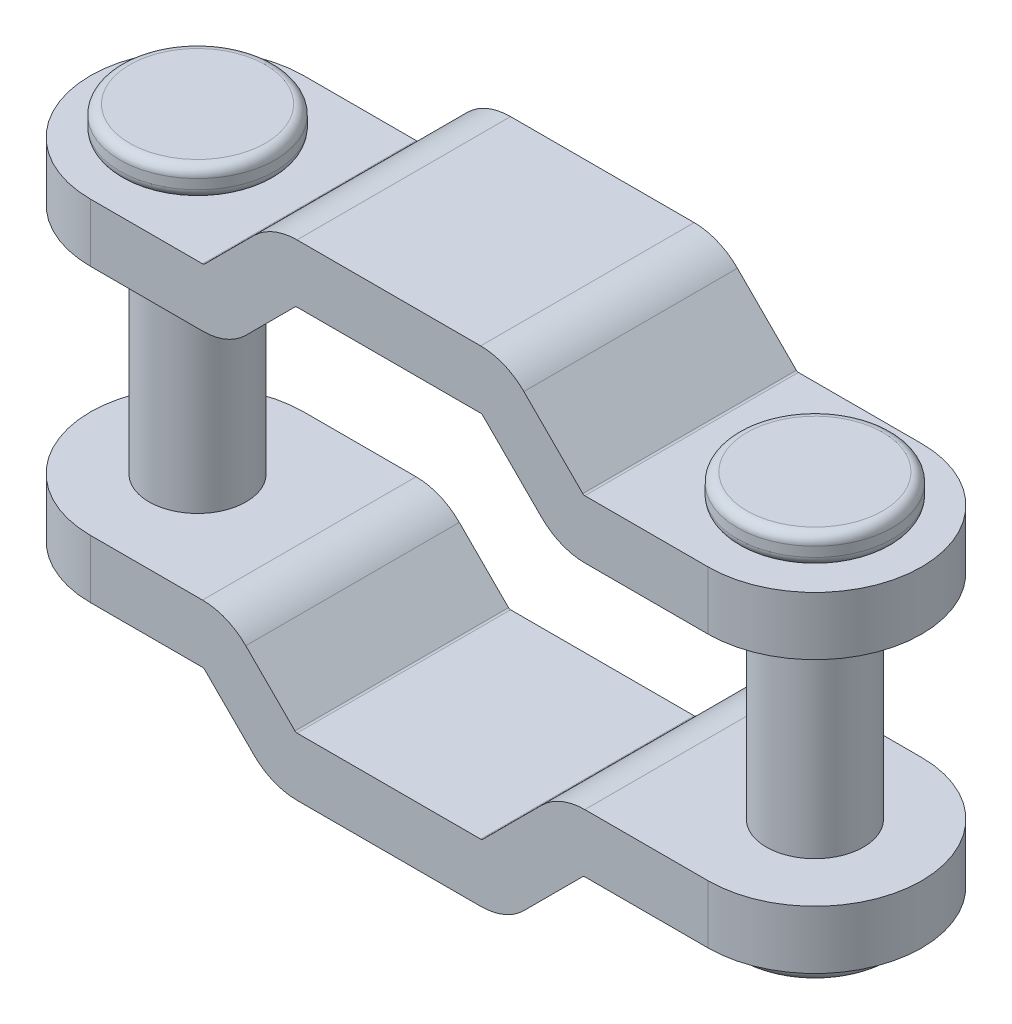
ISO-10303-21;
HEADER;
FILE_DESCRIPTION(('STEP AP214'),'2;1');
FILE_NAME('part.step','',(''),(''),'','','');
FILE_SCHEMA(('AUTOMOTIVE_DESIGN { 1 0 10303 214 1 1 1 1 }'));
ENDSEC;
DATA;
#1=APPLICATION_CONTEXT('core data for automotive mechanical design processes');
#2=APPLICATION_PROTOCOL_DEFINITION('international standard','automotive_design',2000,#1);
#3=PRODUCT_CONTEXT('',#1,'mechanical');
#4=PRODUCT('Part','Part','',(#3));
#5=PRODUCT_RELATED_PRODUCT_CATEGORY('part','',(#4));
#6=PRODUCT_DEFINITION_FORMATION('','',#4);
#7=PRODUCT_DEFINITION_CONTEXT('part definition',#1,'design');
#8=PRODUCT_DEFINITION('design','',#6,#7);
#9=PRODUCT_DEFINITION_SHAPE('','',#8);
#10=(LENGTH_UNIT() NAMED_UNIT(*) SI_UNIT(.MILLI.,.METRE.));
#11=(NAMED_UNIT(*) PLANE_ANGLE_UNIT() SI_UNIT($,.RADIAN.));
#12=(NAMED_UNIT(*) SI_UNIT($,.STERADIAN.) SOLID_ANGLE_UNIT());
#13=UNCERTAINTY_MEASURE_WITH_UNIT(LENGTH_MEASURE(1.E-05),#10,'distance_accuracy_value','');
#14=(GEOMETRIC_REPRESENTATION_CONTEXT(3) GLOBAL_UNCERTAINTY_ASSIGNED_CONTEXT((#13)) GLOBAL_UNIT_ASSIGNED_CONTEXT((#10,
#11,#12)) REPRESENTATION_CONTEXT('',''));
#15=CARTESIAN_POINT('',(0.,0.,0.));
#16=DIRECTION('',(0.,0.,1.));
#17=DIRECTION('',(1.,0.,0.));
#18=AXIS2_PLACEMENT_3D('',#15,#16,#17);
#19=CARTESIAN_POINT('',(0.,10.5,0.));
#20=DIRECTION('',(0.,-1.,0.));
#21=DIRECTION('',(0.,0.,-1.));
#22=AXIS2_PLACEMENT_3D('',#19,#20,#21);
#23=PLANE('',#22);
#24=CARTESIAN_POINT('',(0.,10.5,0.));
#25=DIRECTION('',(0.,-1.,0.));
#26=DIRECTION('',(0.965893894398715,0.,-0.258938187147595));
#27=AXIS2_PLACEMENT_3D('',#24,#25,#26);
#28=CIRCLE('',#27,3.5);
#29=CARTESIAN_POINT('',(3.3806286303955,10.5,-0.906283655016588));
#30=VERTEX_POINT('',#29);
#31=CARTESIAN_POINT('',(-3.3806286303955,10.5,0.906283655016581));
#32=VERTEX_POINT('',#31);
#33=EDGE_CURVE('E728',#30,#32,#28,.T.);
#34=ORIENTED_EDGE('',*,*,#33,.F.);
#35=CARTESIAN_POINT('',(0.,10.5,0.));
#36=DIRECTION('',(0.,-1.,0.));
#37=DIRECTION('',(-0.965893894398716,0.,0.258938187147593));
#38=AXIS2_PLACEMENT_3D('',#35,#36,#37);
#39=CIRCLE('',#38,3.5);
#40=EDGE_CURVE('E740',#32,#30,#39,.T.);
#41=ORIENTED_EDGE('',*,*,#40,.F.);
#42=EDGE_LOOP('',(#34,#41));
#43=FACE_BOUND('',#42,.T.);
#44=ADVANCED_FACE('F17',(#43),#23,.F.);
#45=CARTESIAN_POINT('',(31.7999999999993,10.,-1.42247325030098E-13));
#46=DIRECTION('',(0.,-1.,0.));
#47=DIRECTION('',(0.,0.,-1.));
#48=AXIS2_PLACEMENT_3D('',#45,#46,#47);
#49=PLANE('',#48);
#50=CARTESIAN_POINT('',(31.7999999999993,10.,-1.42247325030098E-13));
#51=DIRECTION('',(0.,-1.,0.));
#52=DIRECTION('',(0.999579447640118,0.,-0.0289987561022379));
#53=AXIS2_PLACEMENT_3D('',#50,#51,#52);
#54=CIRCLE('',#53,3.49999999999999);
#55=CARTESIAN_POINT('',(35.2985280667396,10.,-0.101495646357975));
#56=VERTEX_POINT('',#55);
#57=CARTESIAN_POINT('',(28.3014719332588,10.,0.10149564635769));
#58=VERTEX_POINT('',#57);
#59=EDGE_CURVE('E659',#56,#58,#54,.T.);
#60=ORIENTED_EDGE('',*,*,#59,.F.);
#61=CARTESIAN_POINT('',(31.7999999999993,10.,-1.42247325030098E-13));
#62=DIRECTION('',(0.,-1.,0.));
#63=DIRECTION('',(-0.999579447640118,0.,0.0289987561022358));
#64=AXIS2_PLACEMENT_3D('',#61,#62,#63);
#65=CIRCLE('',#64,3.49999999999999);
#66=EDGE_CURVE('E690',#58,#56,#65,.T.);
#67=ORIENTED_EDGE('',*,*,#66,.F.);
#68=EDGE_LOOP('',(#60,#67));
#69=FACE_BOUND('',#68,.T.);
#70=ADVANCED_FACE('F698',(#69),#49,.F.);
#71=CARTESIAN_POINT('',(0.,10.,0.));
#72=DIRECTION('',(0.,-1.,0.));
#73=DIRECTION('',(0.965893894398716,0.,-0.258938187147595));
#74=AXIS2_PLACEMENT_3D('',#71,#72,#73);
#75=TOROIDAL_SURFACE('',#74,3.5,0.5);
#76=ORIENTED_EDGE('',*,*,#33,.T.);
#77=ORIENTED_EDGE('',*,*,#40,.T.);
#78=EDGE_LOOP('',(#76,#77));
#79=FACE_BOUND('',#78,.T.);
#80=CARTESIAN_POINT('',(0.,10.,0.));
#81=DIRECTION('',(0.,1.,0.));
#82=DIRECTION('',(0.,0.,1.));
#83=AXIS2_PLACEMENT_3D('',#80,#81,#82);
#84=CIRCLE('',#83,4.);
#85=CARTESIAN_POINT('',(0.,10.,4.));
#86=VERTEX_POINT('',#85);
#87=EDGE_CURVE('E685',#86,#86,#84,.F.);
#88=ORIENTED_EDGE('',*,*,#87,.F.);
#89=EDGE_LOOP('',(#88));
#90=FACE_BOUND('',#89,.T.);
#91=ADVANCED_FACE('F676',(#79,#90),#75,.T.);
#92=CARTESIAN_POINT('',(31.7999999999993,9.5,-1.42247325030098E-13));
#93=DIRECTION('',(0.,-1.,0.));
#94=DIRECTION('',(0.999579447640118,0.,-0.0289987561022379));
#95=AXIS2_PLACEMENT_3D('',#92,#93,#94);
#96=TOROIDAL_SURFACE('',#95,3.49999999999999,0.5);
#97=ORIENTED_EDGE('',*,*,#59,.T.);
#98=ORIENTED_EDGE('',*,*,#66,.T.);
#99=EDGE_LOOP('',(#97,#98));
#100=FACE_BOUND('',#99,.T.);
#101=CARTESIAN_POINT('',(31.7999999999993,9.5,-1.42247325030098E-13));
#102=DIRECTION('',(0.,1.,0.));
#103=DIRECTION('',(0.,0.,1.));
#104=AXIS2_PLACEMENT_3D('',#101,#102,#103);
#105=CIRCLE('',#104,4.);
#106=CARTESIAN_POINT('',(31.7999999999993,9.5,3.99999999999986));
#107=VERTEX_POINT('',#106);
#108=EDGE_CURVE('E280',#107,#107,#105,.F.);
#109=ORIENTED_EDGE('',*,*,#108,.F.);
#110=EDGE_LOOP('',(#109));
#111=FACE_BOUND('',#110,.T.);
#112=ADVANCED_FACE('F665',(#100,#111),#96,.T.);
#113=CARTESIAN_POINT('',(0.,9.,0.));
#114=DIRECTION('',(0.,1.,0.));
#115=DIRECTION('',(0.,0.,1.));
#116=AXIS2_PLACEMENT_3D('',#113,#114,#115);
#117=CYLINDRICAL_SURFACE('',#116,4.);
#118=CARTESIAN_POINT('',(0.,9.5,0.));
#119=DIRECTION('',(0.,-1.,0.));
#120=DIRECTION('',(0.965893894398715,0.,-0.258938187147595));
#121=AXIS2_PLACEMENT_3D('',#118,#119,#120);
#122=CIRCLE('',#121,4.);
#123=CARTESIAN_POINT('',(3.86357557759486,9.5,-1.03575274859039));
#124=VERTEX_POINT('',#123);
#125=EDGE_CURVE('E490',#124,#124,#122,.T.);
#126=ORIENTED_EDGE('',*,*,#125,.F.);
#127=EDGE_LOOP('',(#126));
#128=FACE_BOUND('',#127,.T.);
#129=ORIENTED_EDGE('',*,*,#87,.T.);
#130=EDGE_LOOP('',(#129));
#131=FACE_BOUND('',#130,.T.);
#132=ADVANCED_FACE('F675',(#128,#131),#117,.T.);
#133=CARTESIAN_POINT('',(31.7999999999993,8.5,-1.42247325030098E-13));
#134=DIRECTION('',(0.,1.,0.));
#135=DIRECTION('',(0.,0.,1.));
#136=AXIS2_PLACEMENT_3D('',#133,#134,#135);
#137=CYLINDRICAL_SURFACE('',#136,4.);
#138=CARTESIAN_POINT('',(31.7999999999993,9.,-1.42247325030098E-13));
#139=DIRECTION('',(0.,-1.,0.));
#140=DIRECTION('',(0.999579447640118,0.,-0.0289987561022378));
#141=AXIS2_PLACEMENT_3D('',#138,#139,#140);
#142=CIRCLE('',#141,4.);
#143=CARTESIAN_POINT('',(35.7983177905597,9.,-0.115995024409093));
#144=VERTEX_POINT('',#143);
#145=EDGE_CURVE('E481',#144,#144,#142,.T.);
#146=ORIENTED_EDGE('',*,*,#145,.F.);
#147=EDGE_LOOP('',(#146));
#148=FACE_BOUND('',#147,.T.);
#149=ORIENTED_EDGE('',*,*,#108,.T.);
#150=EDGE_LOOP('',(#149));
#151=FACE_BOUND('',#150,.T.);
#152=ADVANCED_FACE('F1147',(#148,#151),#137,.T.);
#153=CARTESIAN_POINT('',(20.0810487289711,9.35,-11.8090988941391));
#154=DIRECTION('',(0.,0.,1.));
#155=DIRECTION('',(1.,0.,0.));
#156=AXIS2_PLACEMENT_3D('',#153,#154,#155);
#157=CYLINDRICAL_SURFACE('',#156,0.15);
#158=CARTESIAN_POINT('',(20.0810487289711,9.35,-5.50000000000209));
#159=DIRECTION('',(0.,0.,1.));
#160=DIRECTION('',(1.,0.,0.));
#161=AXIS2_PLACEMENT_3D('',#158,#159,#160);
#162=CIRCLE('',#161,0.15);
#163=CARTESIAN_POINT('',(20.1871147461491,9.456066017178,-5.50000000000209));
#164=VERTEX_POINT('',#163);
#165=CARTESIAN_POINT('',(20.0810487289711,9.5,-5.50000000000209));
#166=VERTEX_POINT('',#165);
#167=EDGE_CURVE('E279',#164,#166,#162,.T.);
#168=ORIENTED_EDGE('',*,*,#167,.F.);
#169=DIRECTION('',(0.,0.,1.));
#170=VECTOR('',#169,1.);
#171=CARTESIAN_POINT('',(20.1871147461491,9.45606601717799,-2.10248485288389E-12));
#172=LINE('',#171,#170);
#173=CARTESIAN_POINT('',(20.1871147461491,9.456066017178,5.49999999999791));
#174=VERTEX_POINT('',#173);
#175=EDGE_CURVE('E283',#164,#174,#172,.T.);
#176=ORIENTED_EDGE('',*,*,#175,.T.);
#177=CARTESIAN_POINT('',(20.0810487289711,9.35,5.49999999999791));
#178=DIRECTION('',(0.,0.,1.));
#179=DIRECTION('',(1.,0.,0.));
#180=AXIS2_PLACEMENT_3D('',#177,#178,#179);
#181=CIRCLE('',#180,0.15);
#182=CARTESIAN_POINT('',(20.0810487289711,9.5,5.49999999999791));
#183=VERTEX_POINT('',#182);
#184=EDGE_CURVE('E268',#183,#174,#181,.F.);
#185=ORIENTED_EDGE('',*,*,#184,.F.);
#186=DIRECTION('',(0.,0.,1.));
#187=VECTOR('',#186,1.);
#188=CARTESIAN_POINT('',(20.0810487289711,9.5,-2.06085148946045E-12));
#189=LINE('',#188,#187);
#190=EDGE_CURVE('E288',#183,#166,#189,.F.);
#191=ORIENTED_EDGE('',*,*,#190,.T.);
#192=EDGE_LOOP('',(#168,#176,#185,#191));
#193=FACE_BOUND('',#192,.T.);
#194=ADVANCED_FACE('F284',(#193),#157,.F.);
#195=CARTESIAN_POINT('',(0.,9.5,0.));
#196=DIRECTION('',(0.,-1.,0.));
#197=DIRECTION('',(0.965893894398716,0.,-0.258938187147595));
#198=AXIS2_PLACEMENT_3D('',#195,#196,#197);
#199=TOROIDAL_SURFACE('',#198,3.5,0.5);
#200=ORIENTED_EDGE('',*,*,#125,.T.);
#201=EDGE_LOOP('',(#200));
#202=FACE_BOUND('',#201,.T.);
#203=CARTESIAN_POINT('',(0.,9.,0.));
#204=DIRECTION('',(0.,1.,0.));
#205=DIRECTION('',(0.965893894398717,0.,-0.258938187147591));
#206=AXIS2_PLACEMENT_3D('',#203,#204,#205);
#207=CIRCLE('',#206,3.5);
#208=CARTESIAN_POINT('',(-3.3806286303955,9.,0.906283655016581));
#209=VERTEX_POINT('',#208);
#210=CARTESIAN_POINT('',(3.3806286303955,9.,-0.906283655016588));
#211=VERTEX_POINT('',#210);
#212=EDGE_CURVE('E1059',#209,#211,#207,.F.);
#213=ORIENTED_EDGE('',*,*,#212,.F.);
#214=CARTESIAN_POINT('',(0.,9.,0.));
#215=DIRECTION('',(0.,1.,0.));
#216=DIRECTION('',(-0.965893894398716,0.,0.258938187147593));
#217=AXIS2_PLACEMENT_3D('',#214,#215,#216);
#218=CIRCLE('',#217,3.5);
#219=EDGE_CURVE('E1054',#211,#209,#218,.F.);
#220=ORIENTED_EDGE('',*,*,#219,.F.);
#221=EDGE_LOOP('',(#213,#220));
#222=FACE_BOUND('',#221,.T.);
#223=ADVANCED_FACE('F634',(#202,#222),#199,.T.);
#224=CARTESIAN_POINT('',(5.7566487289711,9.15,-11.8090988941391));
#225=DIRECTION('',(0.,0.,1.));
#226=DIRECTION('',(1.,0.,0.));
#227=AXIS2_PLACEMENT_3D('',#224,#225,#226);
#228=CYLINDRICAL_SURFACE('',#227,0.15);
#229=DIRECTION('',(0.,0.,1.));
#230=VECTOR('',#229,1.);
#231=CARTESIAN_POINT('',(5.75664872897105,9.,-2.08513761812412E-12));
#232=LINE('',#231,#230);
#233=CARTESIAN_POINT('',(5.75664872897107,9.,5.49999999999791));
#234=VERTEX_POINT('',#233);
#235=CARTESIAN_POINT('',(5.75664872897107,9.,-5.50000000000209));
#236=VERTEX_POINT('',#235);
#237=EDGE_CURVE('E1049',#234,#236,#232,.F.);
#238=ORIENTED_EDGE('',*,*,#237,.F.);
#239=CARTESIAN_POINT('',(5.7566487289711,9.15,5.49999999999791));
#240=DIRECTION('',(0.,0.,1.));
#241=DIRECTION('',(1.,0.,0.));
#242=AXIS2_PLACEMENT_3D('',#239,#240,#241);
#243=CIRCLE('',#242,0.15);
#244=CARTESIAN_POINT('',(5.86271474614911,9.043933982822,5.49999999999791));
#245=VERTEX_POINT('',#244);
#246=EDGE_CURVE('E488',#245,#234,#243,.F.);
#247=ORIENTED_EDGE('',*,*,#246,.F.);
#248=DIRECTION('',(0.,0.,1.));
#249=VECTOR('',#248,1.);
#250=CARTESIAN_POINT('',(5.86271474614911,9.04393398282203,-2.10248485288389E-12));
#251=LINE('',#250,#249);
#252=CARTESIAN_POINT('',(5.86271474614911,9.04393398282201,-5.50000000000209));
#253=VERTEX_POINT('',#252);
#254=EDGE_CURVE('E1064',#253,#245,#251,.T.);
#255=ORIENTED_EDGE('',*,*,#254,.F.);
#256=CARTESIAN_POINT('',(5.7566487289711,9.15,-5.50000000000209));
#257=DIRECTION('',(0.,0.,1.));
#258=DIRECTION('',(1.,0.,0.));
#259=AXIS2_PLACEMENT_3D('',#256,#257,#258);
#260=CIRCLE('',#259,0.15);
#261=EDGE_CURVE('E486',#236,#253,#260,.T.);
#262=ORIENTED_EDGE('',*,*,#261,.F.);
#263=EDGE_LOOP('',(#238,#247,#255,#262));
#264=FACE_BOUND('',#263,.T.);
#265=ADVANCED_FACE('F638',(#264),#228,.F.);
#266=CARTESIAN_POINT('',(25.4479534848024,8.65,-11.4751633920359));
#267=DIRECTION('',(0.,0.,1.));
#268=DIRECTION('',(1.,0.,0.));
#269=AXIS2_PLACEMENT_3D('',#266,#267,#268);
#270=CYLINDRICAL_SURFACE('',#269,0.15);
#271=CARTESIAN_POINT('',(25.4479534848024,8.65,5.49999999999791));
#272=DIRECTION('',(0.,0.,1.));
#273=DIRECTION('',(1.,0.,0.));
#274=AXIS2_PLACEMENT_3D('',#271,#272,#273);
#275=CIRCLE('',#274,0.15);
#276=CARTESIAN_POINT('',(25.4479534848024,8.5,5.49999999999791));
#277=VERTEX_POINT('',#276);
#278=CARTESIAN_POINT('',(25.3418874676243,8.54393398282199,5.49999999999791));
#279=VERTEX_POINT('',#278);
#280=EDGE_CURVE('E482',#277,#279,#275,.F.);
#281=ORIENTED_EDGE('',*,*,#280,.F.);
#282=DIRECTION('',(0.,0.,1.));
#283=VECTOR('',#282,1.);
#284=CARTESIAN_POINT('',(25.4479534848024,8.5,-2.08513761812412E-12));
#285=LINE('',#284,#283);
#286=CARTESIAN_POINT('',(25.4479534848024,8.5,-5.50000000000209));
#287=VERTEX_POINT('',#286);
#288=EDGE_CURVE('E1674',#287,#277,#285,.T.);
#289=ORIENTED_EDGE('',*,*,#288,.F.);
#290=CARTESIAN_POINT('',(25.4479534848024,8.65,-5.50000000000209));
#291=DIRECTION('',(0.,0.,1.));
#292=DIRECTION('',(1.,0.,0.));
#293=AXIS2_PLACEMENT_3D('',#290,#291,#292);
#294=CIRCLE('',#293,0.15);
#295=CARTESIAN_POINT('',(25.3418874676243,8.54393398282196,-5.50000000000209));
#296=VERTEX_POINT('',#295);
#297=EDGE_CURVE('E484',#296,#287,#294,.T.);
#298=ORIENTED_EDGE('',*,*,#297,.F.);
#299=DIRECTION('',(0.,0.,1.));
#300=VECTOR('',#299,1.);
#301=CARTESIAN_POINT('',(25.3418874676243,8.54393398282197,-2.08860706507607E-12));
#302=LINE('',#301,#300);
#303=EDGE_CURVE('E1676',#279,#296,#302,.F.);
#304=ORIENTED_EDGE('',*,*,#303,.F.);
#305=EDGE_LOOP('',(#281,#289,#298,#304));
#306=FACE_BOUND('',#305,.T.);
#307=ADVANCED_FACE('F610',(#306),#270,.F.);
#308=CARTESIAN_POINT('',(31.7999999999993,9.,-1.42247325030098E-13));
#309=DIRECTION('',(0.,-1.,0.));
#310=DIRECTION('',(0.999579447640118,0.,-0.0289987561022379));
#311=AXIS2_PLACEMENT_3D('',#308,#309,#310);
#312=TOROIDAL_SURFACE('',#311,3.49999999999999,0.5);
#313=ORIENTED_EDGE('',*,*,#145,.T.);
#314=EDGE_LOOP('',(#313));
#315=FACE_BOUND('',#314,.T.);
#316=CARTESIAN_POINT('',(31.7999999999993,8.5,-1.42247325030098E-13));
#317=DIRECTION('',(0.,1.,0.));
#318=DIRECTION('',(0.999579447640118,0.,-0.0289987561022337));
#319=AXIS2_PLACEMENT_3D('',#316,#317,#318);
#320=CIRCLE('',#319,3.49999999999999);
#321=CARTESIAN_POINT('',(28.3014719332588,8.5,0.10149564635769));
#322=VERTEX_POINT('',#321);
#323=CARTESIAN_POINT('',(35.2985280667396,8.5,-0.101495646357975));
#324=VERTEX_POINT('',#323);
#325=EDGE_CURVE('E620',#322,#324,#320,.F.);
#326=ORIENTED_EDGE('',*,*,#325,.F.);
#327=CARTESIAN_POINT('',(31.7999999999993,8.5,-1.42247325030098E-13));
#328=DIRECTION('',(0.,1.,0.));
#329=DIRECTION('',(-0.999579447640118,0.,0.0289987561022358));
#330=AXIS2_PLACEMENT_3D('',#327,#328,#329);
#331=CIRCLE('',#330,3.49999999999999);
#332=EDGE_CURVE('E591',#324,#322,#331,.F.);
#333=ORIENTED_EDGE('',*,*,#332,.F.);
#334=EDGE_LOOP('',(#326,#333));
#335=FACE_BOUND('',#334,.T.);
#336=ADVANCED_FACE('F598',(#315,#335),#312,.T.);
#337=CARTESIAN_POINT('',(10.6235534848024,9.35,-11.4751633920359));
#338=DIRECTION('',(0.,0.,1.));
#339=DIRECTION('',(1.,0.,0.));
#340=AXIS2_PLACEMENT_3D('',#337,#338,#339);
#341=CYLINDRICAL_SURFACE('',#340,0.15);
#342=DIRECTION('',(0.,0.,1.));
#343=VECTOR('',#342,1.);
#344=CARTESIAN_POINT('',(10.6235534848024,9.5,-2.06085148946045E-12));
#345=LINE('',#344,#343);
#346=CARTESIAN_POINT('',(10.6235534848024,9.5,-5.50000000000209));
#347=VERTEX_POINT('',#346);
#348=CARTESIAN_POINT('',(10.6235534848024,9.5,5.49999999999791));
#349=VERTEX_POINT('',#348);
#350=EDGE_CURVE('E1052',#347,#349,#345,.T.);
#351=ORIENTED_EDGE('',*,*,#350,.T.);
#352=CARTESIAN_POINT('',(10.6235534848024,9.35,5.49999999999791));
#353=DIRECTION('',(0.,0.,1.));
#354=DIRECTION('',(1.,0.,0.));
#355=AXIS2_PLACEMENT_3D('',#352,#353,#354);
#356=CIRCLE('',#355,0.15);
#357=CARTESIAN_POINT('',(10.5174874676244,9.45606601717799,5.49999999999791));
#358=VERTEX_POINT('',#357);
#359=EDGE_CURVE('E479',#358,#349,#356,.F.);
#360=ORIENTED_EDGE('',*,*,#359,.F.);
#361=DIRECTION('',(0.,0.,1.));
#362=VECTOR('',#361,1.);
#363=CARTESIAN_POINT('',(10.5174874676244,9.45606601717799,-2.10248485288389E-12));
#364=LINE('',#363,#362);
#365=CARTESIAN_POINT('',(10.5174874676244,9.45606601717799,-5.50000000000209));
#366=VERTEX_POINT('',#365);
#367=EDGE_CURVE('E449',#358,#366,#364,.F.);
#368=ORIENTED_EDGE('',*,*,#367,.T.);
#369=CARTESIAN_POINT('',(10.6235534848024,9.35,-5.50000000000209));
#370=DIRECTION('',(0.,0.,1.));
#371=DIRECTION('',(1.,0.,0.));
#372=AXIS2_PLACEMENT_3D('',#369,#370,#371);
#373=CIRCLE('',#372,0.15);
#374=EDGE_CURVE('E289',#347,#366,#373,.T.);
#375=ORIENTED_EDGE('',*,*,#374,.F.);
#376=EDGE_LOOP('',(#351,#360,#368,#375));
#377=FACE_BOUND('',#376,.T.);
#378=ADVANCED_FACE('F609',(#377),#341,.F.);
#379=CARTESIAN_POINT('',(28.6284868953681,1.01469386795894,-2.10248485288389E-12));
#380=DIRECTION('',(0.707106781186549,0.707106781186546,0.));
#381=DIRECTION('',(-0.707106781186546,0.707106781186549,0.));
#382=AXIS2_PLACEMENT_3D('',#379,#380,#381);
#383=PLANE('',#382);
#384=DIRECTION('',(0.707106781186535,-0.70710678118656,0.));
#385=VECTOR('',#384,1.);
#386=CARTESIAN_POINT('',(20.1871147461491,9.45606601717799,-5.50000000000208));
#387=LINE('',#386,#385);
#388=CARTESIAN_POINT('',(23.2205671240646,6.4226136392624,-5.50000000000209));
#389=VERTEX_POINT('',#388);
#390=EDGE_CURVE('E313',#164,#389,#387,.T.);
#391=ORIENTED_EDGE('',*,*,#390,.T.);
#392=DIRECTION('',(0.,0.,1.));
#393=VECTOR('',#392,1.);
#394=CARTESIAN_POINT('',(23.2205671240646,6.42261363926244,-11.4751633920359));
#395=LINE('',#394,#393);
#396=CARTESIAN_POINT('',(23.2205671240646,6.4226136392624,5.49999999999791));
#397=VERTEX_POINT('',#396);
#398=EDGE_CURVE('E292',#397,#389,#395,.F.);
#399=ORIENTED_EDGE('',*,*,#398,.F.);
#400=DIRECTION('',(-0.707106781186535,0.70710678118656,0.));
#401=VECTOR('',#400,1.);
#402=CARTESIAN_POINT('',(23.2205671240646,6.42261363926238,5.49999999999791));
#403=LINE('',#402,#401);
#404=EDGE_CURVE('E275',#397,#174,#403,.T.);
#405=ORIENTED_EDGE('',*,*,#404,.T.);
#406=ORIENTED_EDGE('',*,*,#175,.F.);
#407=EDGE_LOOP('',(#391,#399,#405,#406));
#408=FACE_BOUND('',#407,.T.);
#409=ADVANCED_FACE('F291',(#408),#383,.F.);
#410=CARTESIAN_POINT('',(33.3148586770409,9.5,-2.06085148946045E-12));
#411=DIRECTION('',(0.,1.,0.));
#412=DIRECTION('',(0.,0.,1.));
#413=AXIS2_PLACEMENT_3D('',#410,#411,#412);
#414=PLANE('',#413);
#415=ORIENTED_EDGE('',*,*,#350,.F.);
#416=DIRECTION('',(1.,0.,0.));
#417=VECTOR('',#416,1.);
#418=CARTESIAN_POINT('',(31.7999999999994,9.5,-5.50000000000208));
#419=LINE('',#418,#417);
#420=EDGE_CURVE('E316',#347,#166,#419,.T.);
#421=ORIENTED_EDGE('',*,*,#420,.T.);
#422=ORIENTED_EDGE('',*,*,#190,.F.);
#423=DIRECTION('',(-1.,0.,0.));
#424=VECTOR('',#423,1.);
#425=CARTESIAN_POINT('',(31.7999999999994,9.5,5.49999999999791));
#426=LINE('',#425,#424);
#427=EDGE_CURVE('E278',#183,#349,#426,.T.);
#428=ORIENTED_EDGE('',*,*,#427,.T.);
#429=EDGE_LOOP('',(#415,#421,#422,#428));
#430=FACE_BOUND('',#429,.T.);
#431=ADVANCED_FACE('F1091',(#430),#414,.F.);
#432=CARTESIAN_POINT('',(34.6226105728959,9.,-2.08513761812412E-12));
#433=DIRECTION('',(0.,1.,0.));
#434=DIRECTION('',(0.,0.,1.));
#435=AXIS2_PLACEMENT_3D('',#432,#433,#434);
#436=PLANE('',#435);
#437=ORIENTED_EDGE('',*,*,#219,.T.);
#438=ORIENTED_EDGE('',*,*,#212,.T.);
#439=EDGE_LOOP('',(#437,#438));
#440=FACE_BOUND('',#439,.T.);
#441=DIRECTION('',(1.,0.,0.));
#442=VECTOR('',#441,1.);
#443=CARTESIAN_POINT('',(31.7999999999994,9.,-5.50000000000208));
#444=LINE('',#443,#442);
#445=CARTESIAN_POINT('',(-0.0244000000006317,9.,-5.50000000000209));
#446=VERTEX_POINT('',#445);
#447=EDGE_CURVE('E322',#236,#446,#444,.F.);
#448=ORIENTED_EDGE('',*,*,#447,.T.);
#449=CARTESIAN_POINT('',(-0.0244000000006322,9.,-2.09207651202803E-12));
#450=DIRECTION('',(0.,-1.,0.));
#451=DIRECTION('',(0.,0.,-1.));
#452=AXIS2_PLACEMENT_3D('',#449,#450,#451);
#453=CIRCLE('',#452,5.5);
#454=CARTESIAN_POINT('',(-0.0244000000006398,9.,5.4999999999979));
#455=VERTEX_POINT('',#454);
#456=EDGE_CURVE('E312',#455,#446,#453,.T.);
#457=ORIENTED_EDGE('',*,*,#456,.F.);
#458=DIRECTION('',(-1.,0.,0.));
#459=VECTOR('',#458,1.);
#460=CARTESIAN_POINT('',(31.7999999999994,9.,5.49999999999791));
#461=LINE('',#460,#459);
#462=EDGE_CURVE('E304',#455,#234,#461,.F.);
#463=ORIENTED_EDGE('',*,*,#462,.T.);
#464=ORIENTED_EDGE('',*,*,#237,.T.);
#465=EDGE_LOOP('',(#448,#457,#463,#464));
#466=FACE_BOUND('',#465,.T.);
#467=ADVANCED_FACE('F1080',(#440,#466),#436,.T.);
#468=CARTESIAN_POINT('',(25.3576875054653,28.5389067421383,-2.10248485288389E-12));
#469=DIRECTION('',(-0.707106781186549,0.707106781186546,0.));
#470=DIRECTION('',(-0.707106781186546,-0.707106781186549,0.));
#471=AXIS2_PLACEMENT_3D('',#468,#469,#470);
#472=PLANE('',#471);
#473=DIRECTION('',(0.,0.,1.));
#474=VECTOR('',#473,1.);
#475=CARTESIAN_POINT('',(8.39616712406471,11.5773863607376,-11.4751633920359));
#476=LINE('',#475,#474);
#477=CARTESIAN_POINT('',(8.3961671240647,11.5773863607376,-5.50000000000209));
#478=VERTEX_POINT('',#477);
#479=CARTESIAN_POINT('',(8.39616712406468,11.5773863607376,5.49999999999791));
#480=VERTEX_POINT('',#479);
#481=EDGE_CURVE('E1068',#478,#480,#476,.T.);
#482=ORIENTED_EDGE('',*,*,#481,.F.);
#483=DIRECTION('',(-0.707106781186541,-0.707106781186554,0.));
#484=VECTOR('',#483,1.);
#485=CARTESIAN_POINT('',(8.39616712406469,11.5773863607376,-5.50000000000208));
#486=LINE('',#485,#484);
#487=EDGE_CURVE('E325',#478,#253,#486,.T.);
#488=ORIENTED_EDGE('',*,*,#487,.T.);
#489=ORIENTED_EDGE('',*,*,#254,.T.);
#490=DIRECTION('',(0.707106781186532,0.707106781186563,0.));
#491=VECTOR('',#490,1.);
#492=CARTESIAN_POINT('',(5.86271474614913,9.043933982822,5.4999999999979));
#493=LINE('',#492,#491);
#494=EDGE_CURVE('E436',#245,#480,#493,.T.);
#495=ORIENTED_EDGE('',*,*,#494,.T.);
#496=EDGE_LOOP('',(#482,#488,#489,#495));
#497=FACE_BOUND('',#496,.T.);
#498=ADVANCED_FACE('F1090',(#497),#472,.T.);
#499=CARTESIAN_POINT('',(10.6235534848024,9.35,-11.4751633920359));
#500=DIRECTION('',(0.,0.,1.));
#501=DIRECTION('',(1.,0.,0.));
#502=AXIS2_PLACEMENT_3D('',#499,#500,#501);
#503=CYLINDRICAL_SURFACE('',#502,3.15);
#504=CARTESIAN_POINT('',(10.6235534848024,9.35,5.49999999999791));
#505=DIRECTION('',(0.,0.,1.));
#506=DIRECTION('',(1.,0.,0.));
#507=AXIS2_PLACEMENT_3D('',#504,#505,#506);
#508=CIRCLE('',#507,3.15);
#509=CARTESIAN_POINT('',(10.6235534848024,12.5,5.49999999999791));
#510=VERTEX_POINT('',#509);
#511=EDGE_CURVE('E435',#480,#510,#508,.F.);
#512=ORIENTED_EDGE('',*,*,#511,.T.);
#513=DIRECTION('',(0.,0.,1.));
#514=VECTOR('',#513,1.);
#515=CARTESIAN_POINT('',(10.6235534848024,12.5,-2.07125983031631E-12));
#516=LINE('',#515,#514);
#517=CARTESIAN_POINT('',(10.6235534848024,12.5,-5.50000000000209));
#518=VERTEX_POINT('',#517);
#519=EDGE_CURVE('E1073',#518,#510,#516,.T.);
#520=ORIENTED_EDGE('',*,*,#519,.F.);
#521=CARTESIAN_POINT('',(10.6235534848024,9.35,-5.50000000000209));
#522=DIRECTION('',(0.,0.,1.));
#523=DIRECTION('',(1.,0.,0.));
#524=AXIS2_PLACEMENT_3D('',#521,#522,#523);
#525=CIRCLE('',#524,3.15);
#526=EDGE_CURVE('E328',#518,#478,#525,.T.);
#527=ORIENTED_EDGE('',*,*,#526,.T.);
#528=ORIENTED_EDGE('',*,*,#481,.T.);
#529=EDGE_LOOP('',(#512,#520,#527,#528));
#530=FACE_BOUND('',#529,.T.);
#531=ADVANCED_FACE('F1356',(#530),#503,.T.);
#532=CARTESIAN_POINT('',(33.3148586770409,12.5,-2.07125983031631E-12));
#533=DIRECTION('',(0.,1.,0.));
#534=DIRECTION('',(0.,0.,1.));
#535=AXIS2_PLACEMENT_3D('',#532,#533,#534);
#536=PLANE('',#535);
#537=DIRECTION('',(0.,0.,1.));
#538=VECTOR('',#537,1.);
#539=CARTESIAN_POINT('',(20.0810487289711,12.5,-11.8090988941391));
#540=LINE('',#539,#538);
#541=CARTESIAN_POINT('',(20.0810487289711,12.5,-5.50000000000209));
#542=VERTEX_POINT('',#541);
#543=CARTESIAN_POINT('',(20.0810487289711,12.5,5.49999999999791));
#544=VERTEX_POINT('',#543);
#545=EDGE_CURVE('E1683',#542,#544,#540,.T.);
#546=ORIENTED_EDGE('',*,*,#545,.F.);
#547=DIRECTION('',(1.,0.,0.));
#548=VECTOR('',#547,1.);
#549=CARTESIAN_POINT('',(31.7999999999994,12.5,-5.50000000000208));
#550=LINE('',#549,#548);
#551=EDGE_CURVE('E329',#542,#518,#550,.F.);
#552=ORIENTED_EDGE('',*,*,#551,.T.);
#553=ORIENTED_EDGE('',*,*,#519,.T.);
#554=DIRECTION('',(-1.,0.,0.));
#555=VECTOR('',#554,1.);
#556=CARTESIAN_POINT('',(31.7999999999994,12.5,5.49999999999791));
#557=LINE('',#556,#555);
#558=EDGE_CURVE('E432',#510,#544,#557,.F.);
#559=ORIENTED_EDGE('',*,*,#558,.T.);
#560=EDGE_LOOP('',(#546,#552,#553,#559));
#561=FACE_BOUND('',#560,.T.);
#562=ADVANCED_FACE('F1365',(#561),#536,.T.);
#563=CARTESIAN_POINT('',(20.0810487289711,9.35,-11.8090988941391));
#564=DIRECTION('',(0.,0.,1.));
#565=DIRECTION('',(1.,0.,0.));
#566=AXIS2_PLACEMENT_3D('',#563,#564,#565);
#567=CYLINDRICAL_SURFACE('',#566,3.15);
#568=DIRECTION('',(0.,0.,1.));
#569=VECTOR('',#568,1.);
#570=CARTESIAN_POINT('',(22.3084350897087,11.5773863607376,-2.08860706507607E-12));
#571=LINE('',#570,#569);
#572=CARTESIAN_POINT('',(22.3084350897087,11.5773863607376,-5.50000000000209));
#573=VERTEX_POINT('',#572);
#574=CARTESIAN_POINT('',(22.3084350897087,11.5773863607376,5.49999999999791));
#575=VERTEX_POINT('',#574);
#576=EDGE_CURVE('E1680',#573,#575,#571,.T.);
#577=ORIENTED_EDGE('',*,*,#576,.F.);
#578=CARTESIAN_POINT('',(20.0810487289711,9.35,-5.50000000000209));
#579=DIRECTION('',(0.,0.,1.));
#580=DIRECTION('',(1.,0.,0.));
#581=AXIS2_PLACEMENT_3D('',#578,#579,#580);
#582=CIRCLE('',#581,3.15);
#583=EDGE_CURVE('E332',#573,#542,#582,.T.);
#584=ORIENTED_EDGE('',*,*,#583,.T.);
#585=ORIENTED_EDGE('',*,*,#545,.T.);
#586=CARTESIAN_POINT('',(20.0810487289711,9.35,5.49999999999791));
#587=DIRECTION('',(0.,0.,1.));
#588=DIRECTION('',(1.,0.,0.));
#589=AXIS2_PLACEMENT_3D('',#586,#587,#588);
#590=CIRCLE('',#589,3.15);
#591=EDGE_CURVE('E431',#544,#575,#590,.F.);
#592=ORIENTED_EDGE('',*,*,#591,.T.);
#593=EDGE_LOOP('',(#577,#584,#585,#592));
#594=FACE_BOUND('',#593,.T.);
#595=ADVANCED_FACE('F1374',(#594),#567,.T.);
#596=CARTESIAN_POINT('',(30.7498072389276,3.13601421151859,-2.08860706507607E-12));
#597=DIRECTION('',(0.707106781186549,0.707106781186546,0.));
#598=DIRECTION('',(-0.707106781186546,0.707106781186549,0.));
#599=AXIS2_PLACEMENT_3D('',#596,#597,#598);
#600=PLANE('',#599);
#601=DIRECTION('',(0.707106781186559,-0.707106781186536,0.));
#602=VECTOR('',#601,1.);
#603=CARTESIAN_POINT('',(22.3084350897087,11.5773863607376,5.49999999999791));
#604=LINE('',#603,#602);
#605=EDGE_CURVE('E428',#575,#279,#604,.T.);
#606=ORIENTED_EDGE('',*,*,#605,.T.);
#607=ORIENTED_EDGE('',*,*,#303,.T.);
#608=DIRECTION('',(-0.707106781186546,0.707106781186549,0.));
#609=VECTOR('',#608,1.);
#610=CARTESIAN_POINT('',(25.3418874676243,8.54393398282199,-5.50000000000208));
#611=LINE('',#610,#609);
#612=EDGE_CURVE('E333',#296,#573,#611,.T.);
#613=ORIENTED_EDGE('',*,*,#612,.T.);
#614=ORIENTED_EDGE('',*,*,#576,.T.);
#615=EDGE_LOOP('',(#606,#607,#613,#614));
#616=FACE_BOUND('',#615,.T.);
#617=ADVANCED_FACE('F1384',(#616),#600,.T.);
#618=CARTESIAN_POINT('',(31.7999999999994,8.5,-2.08513761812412E-12));
#619=DIRECTION('',(0.,1.,0.));
#620=DIRECTION('',(0.,0.,1.));
#621=AXIS2_PLACEMENT_3D('',#618,#619,#620);
#622=PLANE('',#621);
#623=ORIENTED_EDGE('',*,*,#332,.T.);
#624=ORIENTED_EDGE('',*,*,#325,.T.);
#625=EDGE_LOOP('',(#623,#624));
#626=FACE_BOUND('',#625,.T.);
#627=DIRECTION('',(-1.,0.,0.));
#628=VECTOR('',#627,1.);
#629=CARTESIAN_POINT('',(31.7999999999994,8.5,5.49999999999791));
#630=LINE('',#629,#628);
#631=CARTESIAN_POINT('',(31.7999999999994,8.5,5.49999999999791));
#632=VERTEX_POINT('',#631);
#633=EDGE_CURVE('E424',#277,#632,#630,.F.);
#634=ORIENTED_EDGE('',*,*,#633,.T.);
#635=CARTESIAN_POINT('',(31.7999999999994,8.5,-2.08513761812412E-12));
#636=DIRECTION('',(0.,-1.,0.));
#637=DIRECTION('',(0.,0.,-1.));
#638=AXIS2_PLACEMENT_3D('',#635,#636,#637);
#639=CIRCLE('',#638,5.5);
#640=CARTESIAN_POINT('',(31.7999999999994,8.5,-5.50000000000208));
#641=VERTEX_POINT('',#640);
#642=EDGE_CURVE('E476',#641,#632,#639,.T.);
#643=ORIENTED_EDGE('',*,*,#642,.F.);
#644=DIRECTION('',(1.,0.,0.));
#645=VECTOR('',#644,1.);
#646=CARTESIAN_POINT('',(31.7999999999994,8.5,-5.50000000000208));
#647=LINE('',#646,#645);
#648=EDGE_CURVE('E336',#641,#287,#647,.F.);
#649=ORIENTED_EDGE('',*,*,#648,.T.);
#650=ORIENTED_EDGE('',*,*,#288,.T.);
#651=EDGE_LOOP('',(#634,#643,#649,#650));
#652=FACE_BOUND('',#651,.T.);
#653=ADVANCED_FACE('F876',(#626,#652),#622,.T.);
#654=CARTESIAN_POINT('',(27.4790078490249,26.4175863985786,-2.10248485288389E-12));
#655=DIRECTION('',(-0.707106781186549,0.707106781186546,0.));
#656=DIRECTION('',(-0.707106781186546,-0.707106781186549,0.));
#657=AXIS2_PLACEMENT_3D('',#654,#655,#656);
#658=PLANE('',#657);
#659=DIRECTION('',(0.,0.,1.));
#660=VECTOR('',#659,1.);
#661=CARTESIAN_POINT('',(7.98403508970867,6.92261363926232,-11.8090988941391));
#662=LINE('',#661,#660);
#663=CARTESIAN_POINT('',(7.98403508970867,6.92261363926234,-5.50000000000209));
#664=VERTEX_POINT('',#663);
#665=CARTESIAN_POINT('',(7.98403508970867,6.92261363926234,5.49999999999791));
#666=VERTEX_POINT('',#665);
#667=EDGE_CURVE('E447',#664,#666,#662,.T.);
#668=ORIENTED_EDGE('',*,*,#667,.F.);
#669=DIRECTION('',(0.707106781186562,0.707106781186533,0.));
#670=VECTOR('',#669,1.);
#671=CARTESIAN_POINT('',(7.98403508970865,6.92261363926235,-5.50000000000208));
#672=LINE('',#671,#670);
#673=EDGE_CURVE('E319',#664,#366,#672,.T.);
#674=ORIENTED_EDGE('',*,*,#673,.T.);
#675=ORIENTED_EDGE('',*,*,#367,.F.);
#676=DIRECTION('',(-0.707106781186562,-0.707106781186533,0.));
#677=VECTOR('',#676,1.);
#678=CARTESIAN_POINT('',(10.5174874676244,9.45606601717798,5.4999999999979));
#679=LINE('',#678,#677);
#680=EDGE_CURVE('E295',#358,#666,#679,.T.);
#681=ORIENTED_EDGE('',*,*,#680,.T.);
#682=EDGE_LOOP('',(#668,#674,#675,#681));
#683=FACE_BOUND('',#682,.T.);
#684=ADVANCED_FACE('F446',(#683),#658,.F.);
#685=CARTESIAN_POINT('',(0.,-10.5,0.));
#686=DIRECTION('',(0.,1.,0.));
#687=DIRECTION('',(0.,0.,1.));
#688=AXIS2_PLACEMENT_3D('',#685,#686,#687);
#689=PLANE('',#688);
#690=CARTESIAN_POINT('',(0.,-10.5,0.));
#691=DIRECTION('',(0.,1.,0.));
#692=DIRECTION('',(-0.965893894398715,0.,0.258938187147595));
#693=AXIS2_PLACEMENT_3D('',#690,#691,#692);
#694=CIRCLE('',#693,3.5);
#695=CARTESIAN_POINT('',(-3.3806286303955,-10.5,0.906283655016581));
#696=VERTEX_POINT('',#695);
#697=CARTESIAN_POINT('',(3.3806286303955,-10.5,-0.906283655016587));
#698=VERTEX_POINT('',#697);
#699=EDGE_CURVE('E455',#696,#698,#694,.T.);
#700=ORIENTED_EDGE('',*,*,#699,.F.);
#701=CARTESIAN_POINT('',(0.,-10.5,0.));
#702=DIRECTION('',(0.,1.,0.));
#703=DIRECTION('',(0.965893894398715,0.,-0.258938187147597));
#704=AXIS2_PLACEMENT_3D('',#701,#702,#703);
#705=CIRCLE('',#704,3.5);
#706=EDGE_CURVE('E458',#698,#696,#705,.T.);
#707=ORIENTED_EDGE('',*,*,#706,.F.);
#708=EDGE_LOOP('',(#700,#707));
#709=FACE_BOUND('',#708,.T.);
#710=ADVANCED_FACE('F371',(#709),#689,.F.);
#711=CARTESIAN_POINT('',(31.7999999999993,-10.,-1.42247325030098E-13));
#712=DIRECTION('',(0.,1.,0.));
#713=DIRECTION('',(0.,0.,1.));
#714=AXIS2_PLACEMENT_3D('',#711,#712,#713);
#715=PLANE('',#714);
#716=CARTESIAN_POINT('',(31.7999999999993,-10.,-1.42247325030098E-13));
#717=DIRECTION('',(0.,1.,0.));
#718=DIRECTION('',(-0.999579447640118,0.,0.0289987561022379));
#719=AXIS2_PLACEMENT_3D('',#716,#717,#718);
#720=CIRCLE('',#719,3.49999999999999);
#721=CARTESIAN_POINT('',(28.3014719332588,-10.,0.10149564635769));
#722=VERTEX_POINT('',#721);
#723=CARTESIAN_POINT('',(35.2985280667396,-10.,-0.101495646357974));
#724=VERTEX_POINT('',#723);
#725=EDGE_CURVE('E354',#722,#724,#720,.T.);
#726=ORIENTED_EDGE('',*,*,#725,.F.);
#727=CARTESIAN_POINT('',(31.7999999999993,-10.,-1.42247325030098E-13));
#728=DIRECTION('',(0.,1.,0.));
#729=DIRECTION('',(0.999579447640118,0.,-0.02899875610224));
#730=AXIS2_PLACEMENT_3D('',#727,#728,#729);
#731=CIRCLE('',#730,3.49999999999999);
#732=EDGE_CURVE('E387',#724,#722,#731,.T.);
#733=ORIENTED_EDGE('',*,*,#732,.F.);
#734=EDGE_LOOP('',(#726,#733));
#735=FACE_BOUND('',#734,.T.);
#736=ADVANCED_FACE('F360',(#735),#715,.F.);
#737=CARTESIAN_POINT('',(31.7999999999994,8.5,-2.08513761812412E-12));
#738=DIRECTION('',(0.,-1.,0.));
#739=DIRECTION('',(0.,0.,-1.));
#740=AXIS2_PLACEMENT_3D('',#737,#738,#739);
#741=CYLINDRICAL_SURFACE('',#740,5.5);
#742=CARTESIAN_POINT('',(31.7999999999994,5.5,-2.08513761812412E-12));
#743=DIRECTION('',(0.,-1.,0.));
#744=DIRECTION('',(0.,0.,-1.));
#745=AXIS2_PLACEMENT_3D('',#742,#743,#744);
#746=CIRCLE('',#745,5.5);
#747=CARTESIAN_POINT('',(31.7999999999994,5.5,5.49999999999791));
#748=VERTEX_POINT('',#747);
#749=CARTESIAN_POINT('',(31.7999999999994,5.5,-5.50000000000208));
#750=VERTEX_POINT('',#749);
#751=EDGE_CURVE('E462',#748,#750,#746,.F.);
#752=ORIENTED_EDGE('',*,*,#751,.T.);
#753=DIRECTION('',(0.,1.,0.));
#754=VECTOR('',#753,1.);
#755=CARTESIAN_POINT('',(31.7999999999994,8.5,-5.50000000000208));
#756=LINE('',#755,#754);
#757=EDGE_CURVE('E339',#750,#641,#756,.T.);
#758=ORIENTED_EDGE('',*,*,#757,.T.);
#759=ORIENTED_EDGE('',*,*,#642,.T.);
#760=DIRECTION('',(0.,1.,0.));
#761=VECTOR('',#760,1.);
#762=CARTESIAN_POINT('',(31.7999999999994,8.5,5.49999999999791));
#763=LINE('',#762,#761);
#764=EDGE_CURVE('E297',#632,#748,#763,.F.);
#765=ORIENTED_EDGE('',*,*,#764,.T.);
#766=EDGE_LOOP('',(#752,#758,#759,#765));
#767=FACE_BOUND('',#766,.T.);
#768=ADVANCED_FACE('F370',(#767),#741,.T.);
#769=CARTESIAN_POINT('',(25.4479534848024,8.65,-11.4751633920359));
#770=DIRECTION('',(0.,0.,1.));
#771=DIRECTION('',(1.,0.,0.));
#772=AXIS2_PLACEMENT_3D('',#769,#770,#771);
#773=CYLINDRICAL_SURFACE('',#772,3.15);
#774=DIRECTION('',(0.,0.,1.));
#775=VECTOR('',#774,1.);
#776=CARTESIAN_POINT('',(25.4479534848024,5.5,-2.08860706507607E-12));
#777=LINE('',#776,#775);
#778=CARTESIAN_POINT('',(25.4479534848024,5.5,-5.50000000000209));
#779=VERTEX_POINT('',#778);
#780=CARTESIAN_POINT('',(25.4479534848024,5.5,5.49999999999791));
#781=VERTEX_POINT('',#780);
#782=EDGE_CURVE('E342',#779,#781,#777,.T.);
#783=ORIENTED_EDGE('',*,*,#782,.T.);
#784=CARTESIAN_POINT('',(25.4479534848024,8.65,5.49999999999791));
#785=DIRECTION('',(0.,0.,1.));
#786=DIRECTION('',(1.,0.,0.));
#787=AXIS2_PLACEMENT_3D('',#784,#785,#786);
#788=CIRCLE('',#787,3.15);
#789=EDGE_CURVE('E293',#781,#397,#788,.F.);
#790=ORIENTED_EDGE('',*,*,#789,.T.);
#791=ORIENTED_EDGE('',*,*,#398,.T.);
#792=CARTESIAN_POINT('',(25.4479534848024,8.65,-5.50000000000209));
#793=DIRECTION('',(0.,0.,1.));
#794=DIRECTION('',(1.,0.,0.));
#795=AXIS2_PLACEMENT_3D('',#792,#793,#794);
#796=CIRCLE('',#795,3.15);
#797=EDGE_CURVE('E315',#389,#779,#796,.T.);
#798=ORIENTED_EDGE('',*,*,#797,.T.);
#799=EDGE_LOOP('',(#783,#790,#791,#798));
#800=FACE_BOUND('',#799,.T.);
#801=ADVANCED_FACE('F1299',(#800),#773,.T.);
#802=CARTESIAN_POINT('',(31.7999999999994,8.5,-5.50000000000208));
#803=DIRECTION('',(0.,0.,1.));
#804=DIRECTION('',(1.,0.,0.));
#805=AXIS2_PLACEMENT_3D('',#802,#803,#804);
#806=PLANE('',#805);
#807=ORIENTED_EDGE('',*,*,#797,.F.);
#808=ORIENTED_EDGE('',*,*,#390,.F.);
#809=ORIENTED_EDGE('',*,*,#167,.T.);
#810=ORIENTED_EDGE('',*,*,#420,.F.);
#811=ORIENTED_EDGE('',*,*,#374,.T.);
#812=ORIENTED_EDGE('',*,*,#673,.F.);
#813=CARTESIAN_POINT('',(5.7566487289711,9.15,-5.50000000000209));
#814=DIRECTION('',(0.,0.,1.));
#815=DIRECTION('',(1.,0.,0.));
#816=AXIS2_PLACEMENT_3D('',#813,#814,#815);
#817=CIRCLE('',#816,3.15);
#818=CARTESIAN_POINT('',(5.75664872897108,6.,-5.50000000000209));
#819=VERTEX_POINT('',#818);
#820=EDGE_CURVE('E427',#819,#664,#817,.T.);
#821=ORIENTED_EDGE('',*,*,#820,.F.);
#822=DIRECTION('',(1.,0.,0.));
#823=VECTOR('',#822,1.);
#824=CARTESIAN_POINT('',(34.6226105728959,6.,-5.50000000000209));
#825=LINE('',#824,#823);
#826=CARTESIAN_POINT('',(-0.0244000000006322,6.,-5.50000000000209));
#827=VERTEX_POINT('',#826);
#828=EDGE_CURVE('E345',#819,#827,#825,.F.);
#829=ORIENTED_EDGE('',*,*,#828,.T.);
#830=DIRECTION('',(0.,-1.,0.));
#831=VECTOR('',#830,1.);
#832=CARTESIAN_POINT('',(-0.0244000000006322,9.,-5.50000000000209));
#833=LINE('',#832,#831);
#834=EDGE_CURVE('E310',#446,#827,#833,.T.);
#835=ORIENTED_EDGE('',*,*,#834,.F.);
#836=ORIENTED_EDGE('',*,*,#447,.F.);
#837=ORIENTED_EDGE('',*,*,#261,.T.);
#838=ORIENTED_EDGE('',*,*,#487,.F.);
#839=ORIENTED_EDGE('',*,*,#526,.F.);
#840=ORIENTED_EDGE('',*,*,#551,.F.);
#841=ORIENTED_EDGE('',*,*,#583,.F.);
#842=ORIENTED_EDGE('',*,*,#612,.F.);
#843=ORIENTED_EDGE('',*,*,#297,.T.);
#844=ORIENTED_EDGE('',*,*,#648,.F.);
#845=ORIENTED_EDGE('',*,*,#757,.F.);
#846=DIRECTION('',(1.,0.,0.));
#847=VECTOR('',#846,1.);
#848=CARTESIAN_POINT('',(31.7999999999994,5.5,-5.50000000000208));
#849=LINE('',#848,#847);
#850=EDGE_CURVE('E346',#750,#779,#849,.F.);
#851=ORIENTED_EDGE('',*,*,#850,.T.);
#852=EDGE_LOOP('',(#807,#808,#809,#810,#811,#812,#821,#829,#835,#836,#837,#838,#839,#840,#841,
#842,#843,#844,#845,#851));
#853=FACE_BOUND('',#852,.T.);
#854=ADVANCED_FACE('F1041',(#853),#806,.F.);
#855=CARTESIAN_POINT('',(-0.0244000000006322,9.,-2.09207651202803E-12));
#856=DIRECTION('',(0.,-1.,0.));
#857=DIRECTION('',(0.,0.,-1.));
#858=AXIS2_PLACEMENT_3D('',#855,#856,#857);
#859=CYLINDRICAL_SURFACE('',#858,5.5);
#860=ORIENTED_EDGE('',*,*,#456,.T.);
#861=ORIENTED_EDGE('',*,*,#834,.T.);
#862=CARTESIAN_POINT('',(-0.0244000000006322,6.,-2.09207651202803E-12));
#863=DIRECTION('',(0.,-1.,0.));
#864=DIRECTION('',(0.,0.,-1.));
#865=AXIS2_PLACEMENT_3D('',#862,#863,#864);
#866=CIRCLE('',#865,5.5);
#867=CARTESIAN_POINT('',(-0.0244000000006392,6.,5.49999999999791));
#868=VERTEX_POINT('',#867);
#869=EDGE_CURVE('E843',#827,#868,#866,.F.);
#870=ORIENTED_EDGE('',*,*,#869,.T.);
#871=DIRECTION('',(0.,1.,0.));
#872=VECTOR('',#871,1.);
#873=CARTESIAN_POINT('',(-0.0244000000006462,8.5,5.4999999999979));
#874=LINE('',#873,#872);
#875=EDGE_CURVE('E301',#868,#455,#874,.T.);
#876=ORIENTED_EDGE('',*,*,#875,.T.);
#877=EDGE_LOOP('',(#860,#861,#870,#876));
#878=FACE_BOUND('',#877,.T.);
#879=ADVANCED_FACE('F1316',(#878),#859,.T.);
#880=CARTESIAN_POINT('',(31.7999999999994,8.5,5.49999999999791));
#881=DIRECTION('',(0.,0.,-1.));
#882=DIRECTION('',(-1.,0.,0.));
#883=AXIS2_PLACEMENT_3D('',#880,#881,#882);
#884=PLANE('',#883);
#885=ORIENTED_EDGE('',*,*,#280,.T.);
#886=ORIENTED_EDGE('',*,*,#605,.F.);
#887=ORIENTED_EDGE('',*,*,#591,.F.);
#888=ORIENTED_EDGE('',*,*,#558,.F.);
#889=ORIENTED_EDGE('',*,*,#511,.F.);
#890=ORIENTED_EDGE('',*,*,#494,.F.);
#891=ORIENTED_EDGE('',*,*,#246,.T.);
#892=ORIENTED_EDGE('',*,*,#462,.F.);
#893=ORIENTED_EDGE('',*,*,#875,.F.);
#894=DIRECTION('',(1.,0.,0.));
#895=VECTOR('',#894,1.);
#896=CARTESIAN_POINT('',(34.6226105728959,6.,5.49999999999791));
#897=LINE('',#896,#895);
#898=CARTESIAN_POINT('',(5.75664872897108,6.,5.49999999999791));
#899=VERTEX_POINT('',#898);
#900=EDGE_CURVE('E309',#868,#899,#897,.T.);
#901=ORIENTED_EDGE('',*,*,#900,.T.);
#902=CARTESIAN_POINT('',(5.75664872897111,9.15,5.49999999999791));
#903=DIRECTION('',(0.,0.,1.));
#904=DIRECTION('',(1.,0.,0.));
#905=AXIS2_PLACEMENT_3D('',#902,#903,#904);
#906=CIRCLE('',#905,3.15);
#907=EDGE_CURVE('E451',#666,#899,#906,.F.);
#908=ORIENTED_EDGE('',*,*,#907,.F.);
#909=ORIENTED_EDGE('',*,*,#680,.F.);
#910=ORIENTED_EDGE('',*,*,#359,.T.);
#911=ORIENTED_EDGE('',*,*,#427,.F.);
#912=ORIENTED_EDGE('',*,*,#184,.T.);
#913=ORIENTED_EDGE('',*,*,#404,.F.);
#914=ORIENTED_EDGE('',*,*,#789,.F.);
#915=DIRECTION('',(1.,0.,0.));
#916=VECTOR('',#915,1.);
#917=CARTESIAN_POINT('',(31.7999999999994,5.5,5.49999999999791));
#918=LINE('',#917,#916);
#919=EDGE_CURVE('E415',#781,#748,#918,.T.);
#920=ORIENTED_EDGE('',*,*,#919,.T.);
#921=ORIENTED_EDGE('',*,*,#764,.F.);
#922=ORIENTED_EDGE('',*,*,#633,.F.);
#923=EDGE_LOOP('',(#885,#886,#887,#888,#889,#890,#891,#892,#893,#901,#908,#909,#910,#911,#912,
#913,#914,#920,#921,#922));
#924=FACE_BOUND('',#923,.T.);
#925=ADVANCED_FACE('F273',(#924),#884,.F.);
#926=CARTESIAN_POINT('',(5.7566487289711,9.15,-11.8090988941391));
#927=DIRECTION('',(0.,0.,1.));
#928=DIRECTION('',(1.,0.,0.));
#929=AXIS2_PLACEMENT_3D('',#926,#927,#928);
#930=CYLINDRICAL_SURFACE('',#929,3.15);
#931=ORIENTED_EDGE('',*,*,#907,.T.);
#932=DIRECTION('',(0.,0.,1.));
#933=VECTOR('',#932,1.);
#934=CARTESIAN_POINT('',(5.75664872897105,6.,-2.08513761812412E-12));
#935=LINE('',#934,#933);
#936=EDGE_CURVE('E305',#899,#819,#935,.F.);
#937=ORIENTED_EDGE('',*,*,#936,.T.);
#938=ORIENTED_EDGE('',*,*,#820,.T.);
#939=ORIENTED_EDGE('',*,*,#667,.T.);
#940=EDGE_LOOP('',(#931,#937,#938,#939));
#941=FACE_BOUND('',#940,.T.);
#942=ADVANCED_FACE('F1040',(#941),#930,.T.);
#943=CARTESIAN_POINT('',(0.,-10.,0.));
#944=DIRECTION('',(0.,1.,0.));
#945=DIRECTION('',(-0.965893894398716,0.,0.258938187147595));
#946=AXIS2_PLACEMENT_3D('',#943,#944,#945);
#947=TOROIDAL_SURFACE('',#946,3.5,0.5);
#948=ORIENTED_EDGE('',*,*,#699,.T.);
#949=ORIENTED_EDGE('',*,*,#706,.T.);
#950=EDGE_LOOP('',(#948,#949));
#951=FACE_BOUND('',#950,.T.);
#952=CARTESIAN_POINT('',(0.,-10.,0.));
#953=DIRECTION('',(0.,-1.,0.));
#954=DIRECTION('',(0.,0.,-1.));
#955=AXIS2_PLACEMENT_3D('',#952,#953,#954);
#956=CIRCLE('',#955,4.);
#957=CARTESIAN_POINT('',(0.,-10.,-4.));
#958=VERTEX_POINT('',#957);
#959=EDGE_CURVE('E308',#958,#958,#956,.F.);
#960=ORIENTED_EDGE('',*,*,#959,.F.);
#961=EDGE_LOOP('',(#960));
#962=FACE_BOUND('',#961,.T.);
#963=ADVANCED_FACE('F406',(#951,#962),#947,.T.);
#964=CARTESIAN_POINT('',(31.7999999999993,-9.5,-1.42247325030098E-13));
#965=DIRECTION('',(0.,1.,0.));
#966=DIRECTION('',(-0.999579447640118,0.,0.0289987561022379));
#967=AXIS2_PLACEMENT_3D('',#964,#965,#966);
#968=TOROIDAL_SURFACE('',#967,3.49999999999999,0.5);
#969=ORIENTED_EDGE('',*,*,#725,.T.);
#970=ORIENTED_EDGE('',*,*,#732,.T.);
#971=EDGE_LOOP('',(#969,#970));
#972=FACE_BOUND('',#971,.T.);
#973=CARTESIAN_POINT('',(31.7999999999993,-9.5,-1.42247325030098E-13));
#974=DIRECTION('',(0.,-1.,0.));
#975=DIRECTION('',(0.,0.,-1.));
#976=AXIS2_PLACEMENT_3D('',#973,#974,#975);
#977=CIRCLE('',#976,4.);
#978=CARTESIAN_POINT('',(31.7999999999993,-9.5,-4.00000000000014));
#979=VERTEX_POINT('',#978);
#980=EDGE_CURVE('E417',#979,#979,#977,.F.);
#981=ORIENTED_EDGE('',*,*,#980,.F.);
#982=EDGE_LOOP('',(#981));
#983=FACE_BOUND('',#982,.T.);
#984=ADVANCED_FACE('F394',(#972,#983),#968,.T.);
#985=CARTESIAN_POINT('',(31.7999999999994,5.5,-2.08860706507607E-12));
#986=DIRECTION('',(0.,1.,0.));
#987=DIRECTION('',(0.,0.,1.));
#988=AXIS2_PLACEMENT_3D('',#985,#986,#987);
#989=PLANE('',#988);
#990=CARTESIAN_POINT('',(31.7999999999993,5.5,-1.42247325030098E-13));
#991=DIRECTION('',(0.,1.,0.));
#992=DIRECTION('',(0.,0.,1.));
#993=AXIS2_PLACEMENT_3D('',#990,#991,#992);
#994=CIRCLE('',#993,2.5);
#995=CARTESIAN_POINT('',(31.7999999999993,5.5,2.49999999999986));
#996=VERTEX_POINT('',#995);
#997=EDGE_CURVE('E419',#996,#996,#994,.F.);
#998=ORIENTED_EDGE('',*,*,#997,.F.);
#999=EDGE_LOOP('',(#998));
#1000=FACE_BOUND('',#999,.T.);
#1001=ORIENTED_EDGE('',*,*,#850,.F.);
#1002=ORIENTED_EDGE('',*,*,#751,.F.);
#1003=ORIENTED_EDGE('',*,*,#919,.F.);
#1004=ORIENTED_EDGE('',*,*,#782,.F.);
#1005=EDGE_LOOP('',(#1001,#1002,#1003,#1004));
#1006=FACE_BOUND('',#1005,.T.);
#1007=ADVANCED_FACE('F405',(#1000,#1006),#989,.F.);
#1008=CARTESIAN_POINT('',(34.6226105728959,6.,-2.08513761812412E-12));
#1009=DIRECTION('',(0.,1.,0.));
#1010=DIRECTION('',(0.,0.,1.));
#1011=AXIS2_PLACEMENT_3D('',#1008,#1009,#1010);
#1012=PLANE('',#1011);
#1013=CARTESIAN_POINT('',(0.,6.,0.));
#1014=DIRECTION('',(0.,1.,0.));
#1015=DIRECTION('',(0.,0.,1.));
#1016=AXIS2_PLACEMENT_3D('',#1013,#1014,#1015);
#1017=CIRCLE('',#1016,2.5);
#1018=CARTESIAN_POINT('',(0.,6.,2.5));
#1019=VERTEX_POINT('',#1018);
#1020=EDGE_CURVE('E839',#1019,#1019,#1017,.F.);
#1021=ORIENTED_EDGE('',*,*,#1020,.F.);
#1022=EDGE_LOOP('',(#1021));
#1023=FACE_BOUND('',#1022,.T.);
#1024=ORIENTED_EDGE('',*,*,#900,.F.);
#1025=ORIENTED_EDGE('',*,*,#869,.F.);
#1026=ORIENTED_EDGE('',*,*,#828,.F.);
#1027=ORIENTED_EDGE('',*,*,#936,.F.);
#1028=EDGE_LOOP('',(#1024,#1025,#1026,#1027));
#1029=FACE_BOUND('',#1028,.T.);
#1030=ADVANCED_FACE('F1029',(#1023,#1029),#1012,.F.);
#1031=CARTESIAN_POINT('',(0.,-9.,0.));
#1032=DIRECTION('',(0.,-1.,0.));
#1033=DIRECTION('',(0.,0.,-1.));
#1034=AXIS2_PLACEMENT_3D('',#1031,#1032,#1033);
#1035=CYLINDRICAL_SURFACE('',#1034,4.);
#1036=CARTESIAN_POINT('',(0.,-9.5,0.));
#1037=DIRECTION('',(0.,1.,0.));
#1038=DIRECTION('',(-0.965893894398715,0.,0.258938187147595));
#1039=AXIS2_PLACEMENT_3D('',#1036,#1037,#1038);
#1040=CIRCLE('',#1039,4.);
#1041=CARTESIAN_POINT('',(-3.86357557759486,-9.5,1.03575274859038));
#1042=VERTEX_POINT('',#1041);
#1043=EDGE_CURVE('E838',#1042,#1042,#1040,.T.);
#1044=ORIENTED_EDGE('',*,*,#1043,.F.);
#1045=EDGE_LOOP('',(#1044));
#1046=FACE_BOUND('',#1045,.T.);
#1047=ORIENTED_EDGE('',*,*,#959,.T.);
#1048=EDGE_LOOP('',(#1047));
#1049=FACE_BOUND('',#1048,.T.);
#1050=ADVANCED_FACE('F1024',(#1046,#1049),#1035,.T.);
#1051=CARTESIAN_POINT('',(31.7999999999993,-8.5,-1.42247325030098E-13));
#1052=DIRECTION('',(0.,-1.,0.));
#1053=DIRECTION('',(0.,0.,-1.));
#1054=AXIS2_PLACEMENT_3D('',#1051,#1052,#1053);
#1055=CYLINDRICAL_SURFACE('',#1054,4.);
#1056=CARTESIAN_POINT('',(31.7999999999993,-9.,-1.42247325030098E-13));
#1057=DIRECTION('',(0.,1.,0.));
#1058=DIRECTION('',(-0.999579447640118,0.,0.0289987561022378));
#1059=AXIS2_PLACEMENT_3D('',#1056,#1057,#1058);
#1060=CIRCLE('',#1059,4.);
#1061=CARTESIAN_POINT('',(27.8016822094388,-9.,0.115995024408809));
#1062=VERTEX_POINT('',#1061);
#1063=EDGE_CURVE('E829',#1062,#1062,#1060,.T.);
#1064=ORIENTED_EDGE('',*,*,#1063,.F.);
#1065=EDGE_LOOP('',(#1064));
#1066=FACE_BOUND('',#1065,.T.);
#1067=ORIENTED_EDGE('',*,*,#980,.T.);
#1068=EDGE_LOOP('',(#1067));
#1069=FACE_BOUND('',#1068,.T.);
#1070=ADVANCED_FACE('F1016',(#1066,#1069),#1055,.T.);
#1071=CARTESIAN_POINT('',(31.7999999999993,-8.5,-1.42247325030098E-13));
#1072=DIRECTION('',(0.,1.,0.));
#1073=DIRECTION('',(0.,0.,1.));
#1074=AXIS2_PLACEMENT_3D('',#1071,#1072,#1073);
#1075=CYLINDRICAL_SURFACE('',#1074,2.5);
#1076=ORIENTED_EDGE('',*,*,#997,.T.);
#1077=EDGE_LOOP('',(#1076));
#1078=FACE_BOUND('',#1077,.T.);
#1079=CARTESIAN_POINT('',(31.7999999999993,-5.5,-1.42247325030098E-13));
#1080=DIRECTION('',(0.,1.,0.));
#1081=DIRECTION('',(0.,0.,1.));
#1082=AXIS2_PLACEMENT_3D('',#1079,#1080,#1081);
#1083=CIRCLE('',#1082,2.5);
#1084=CARTESIAN_POINT('',(31.7999999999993,-5.5,2.49999999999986));
#1085=VERTEX_POINT('',#1084);
#1086=EDGE_CURVE('E822',#1085,#1085,#1083,.T.);
#1087=ORIENTED_EDGE('',*,*,#1086,.T.);
#1088=EDGE_LOOP('',(#1087));
#1089=FACE_BOUND('',#1088,.T.);
#1090=ADVANCED_FACE('F1014',(#1078,#1089),#1075,.T.);
#1091=CARTESIAN_POINT('',(0.,-9.,0.));
#1092=DIRECTION('',(0.,1.,0.));
#1093=DIRECTION('',(0.,0.,1.));
#1094=AXIS2_PLACEMENT_3D('',#1091,#1092,#1093);
#1095=CYLINDRICAL_SURFACE('',#1094,2.5);
#1096=ORIENTED_EDGE('',*,*,#1020,.T.);
#1097=EDGE_LOOP('',(#1096));
#1098=FACE_BOUND('',#1097,.T.);
#1099=CARTESIAN_POINT('',(0.,-6.,0.));
#1100=DIRECTION('',(0.,1.,0.));
#1101=DIRECTION('',(0.,0.,1.));
#1102=AXIS2_PLACEMENT_3D('',#1099,#1100,#1101);
#1103=CIRCLE('',#1102,2.5);
#1104=CARTESIAN_POINT('',(0.,-6.,2.5));
#1105=VERTEX_POINT('',#1104);
#1106=EDGE_CURVE('E818',#1105,#1105,#1103,.T.);
#1107=ORIENTED_EDGE('',*,*,#1106,.T.);
#1108=EDGE_LOOP('',(#1107));
#1109=FACE_BOUND('',#1108,.T.);
#1110=ADVANCED_FACE('F548',(#1098,#1109),#1095,.T.);
#1111=CARTESIAN_POINT('',(0.,-9.5,0.));
#1112=DIRECTION('',(0.,1.,0.));
#1113=DIRECTION('',(-0.965893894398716,0.,0.258938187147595));
#1114=AXIS2_PLACEMENT_3D('',#1111,#1112,#1113);
#1115=TOROIDAL_SURFACE('',#1114,3.5,0.5);
#1116=ORIENTED_EDGE('',*,*,#1043,.T.);
#1117=EDGE_LOOP('',(#1116));
#1118=FACE_BOUND('',#1117,.T.);
#1119=CARTESIAN_POINT('',(0.,-9.,0.));
#1120=DIRECTION('',(0.,-1.,0.));
#1121=DIRECTION('',(-0.965893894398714,0.,0.258938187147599));
#1122=AXIS2_PLACEMENT_3D('',#1119,#1120,#1121);
#1123=CIRCLE('',#1122,3.5);
#1124=CARTESIAN_POINT('',(3.3806286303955,-9.,-0.906283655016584));
#1125=VERTEX_POINT('',#1124);
#1126=CARTESIAN_POINT('',(-3.3806286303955,-9.,0.906283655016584));
#1127=VERTEX_POINT('',#1126);
#1128=EDGE_CURVE('E1636',#1125,#1127,#1123,.F.);
#1129=ORIENTED_EDGE('',*,*,#1128,.F.);
#1130=CARTESIAN_POINT('',(0.,-9.,0.));
#1131=DIRECTION('',(0.,-1.,0.));
#1132=DIRECTION('',(0.965893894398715,0.,-0.258938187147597));
#1133=AXIS2_PLACEMENT_3D('',#1130,#1131,#1132);
#1134=CIRCLE('',#1133,3.5);
#1135=EDGE_CURVE('E814',#1127,#1125,#1134,.F.);
#1136=ORIENTED_EDGE('',*,*,#1135,.F.);
#1137=EDGE_LOOP('',(#1129,#1136));
#1138=FACE_BOUND('',#1137,.T.);
#1139=ADVANCED_FACE('F543',(#1118,#1138),#1115,.T.);
#1140=CARTESIAN_POINT('',(5.7566487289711,-9.15,11.8090988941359));
#1141=DIRECTION('',(0.,0.,-1.));
#1142=DIRECTION('',(-1.,0.,0.));
#1143=AXIS2_PLACEMENT_3D('',#1140,#1141,#1142);
#1144=CYLINDRICAL_SURFACE('',#1143,0.15);
#1145=DIRECTION('',(0.,0.,-1.));
#1146=VECTOR('',#1145,1.);
#1147=CARTESIAN_POINT('',(5.75664872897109,-9.,-1.05124242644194E-12));
#1148=LINE('',#1147,#1146);
#1149=CARTESIAN_POINT('',(5.75664872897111,-9.,-5.50000000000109));
#1150=VERTEX_POINT('',#1149);
#1151=CARTESIAN_POINT('',(5.7566487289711,-9.,5.49999999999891));
#1152=VERTEX_POINT('',#1151);
#1153=EDGE_CURVE('E815',#1150,#1152,#1148,.F.);
#1154=ORIENTED_EDGE('',*,*,#1153,.F.);
#1155=CARTESIAN_POINT('',(5.75664872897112,-9.15,-5.50000000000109));
#1156=DIRECTION('',(0.,0.,-1.));
#1157=DIRECTION('',(-1.,0.,0.));
#1158=AXIS2_PLACEMENT_3D('',#1155,#1156,#1157);
#1159=CIRCLE('',#1158,0.15);
#1160=CARTESIAN_POINT('',(5.86271474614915,-9.04393398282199,-5.50000000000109));
#1161=VERTEX_POINT('',#1160);
#1162=EDGE_CURVE('E836',#1161,#1150,#1159,.F.);
#1163=ORIENTED_EDGE('',*,*,#1162,.F.);
#1164=DIRECTION('',(0.,0.,1.));
#1165=VECTOR('',#1164,1.);
#1166=CARTESIAN_POINT('',(5.86271474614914,-9.04393398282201,-1.04777297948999E-12));
#1167=LINE('',#1166,#1165);
#1168=CARTESIAN_POINT('',(5.86271474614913,-9.043933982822,5.49999999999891));
#1169=VERTEX_POINT('',#1168);
#1170=EDGE_CURVE('E1634',#1169,#1161,#1167,.F.);
#1171=ORIENTED_EDGE('',*,*,#1170,.F.);
#1172=CARTESIAN_POINT('',(5.75664872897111,-9.15,5.49999999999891));
#1173=DIRECTION('',(0.,0.,-1.));
#1174=DIRECTION('',(-1.,0.,0.));
#1175=AXIS2_PLACEMENT_3D('',#1172,#1173,#1174);
#1176=CIRCLE('',#1175,0.15);
#1177=EDGE_CURVE('E834',#1152,#1169,#1176,.T.);
#1178=ORIENTED_EDGE('',*,*,#1177,.F.);
#1179=EDGE_LOOP('',(#1154,#1163,#1171,#1178));
#1180=FACE_BOUND('',#1179,.T.);
#1181=ADVANCED_FACE('F547',(#1180),#1144,.F.);
#1182=CARTESIAN_POINT('',(25.4479534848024,-8.65,11.4751633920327));
#1183=DIRECTION('',(0.,0.,-1.));
#1184=DIRECTION('',(-1.,0.,0.));
#1185=AXIS2_PLACEMENT_3D('',#1182,#1183,#1184);
#1186=CYLINDRICAL_SURFACE('',#1185,0.15);
#1187=CARTESIAN_POINT('',(25.4479534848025,-8.65,-5.50000000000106));
#1188=DIRECTION('',(0.,0.,-1.));
#1189=DIRECTION('',(-1.,0.,0.));
#1190=AXIS2_PLACEMENT_3D('',#1187,#1188,#1189);
#1191=CIRCLE('',#1190,0.15);
#1192=CARTESIAN_POINT('',(25.4479534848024,-8.5,-5.50000000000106));
#1193=VERTEX_POINT('',#1192);
#1194=CARTESIAN_POINT('',(25.3418874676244,-8.54393398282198,-5.50000000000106));
#1195=VERTEX_POINT('',#1194);
#1196=EDGE_CURVE('E830',#1193,#1195,#1191,.F.);
#1197=ORIENTED_EDGE('',*,*,#1196,.F.);
#1198=DIRECTION('',(0.,0.,-1.));
#1199=VECTOR('',#1198,1.);
#1200=CARTESIAN_POINT('',(25.4479534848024,-8.5,-1.06165076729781E-12));
#1201=LINE('',#1200,#1199);
#1202=CARTESIAN_POINT('',(25.4479534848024,-8.5,5.49999999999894));
#1203=VERTEX_POINT('',#1202);
#1204=EDGE_CURVE('E811',#1203,#1193,#1201,.T.);
#1205=ORIENTED_EDGE('',*,*,#1204,.F.);
#1206=CARTESIAN_POINT('',(25.4479534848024,-8.65,5.49999999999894));
#1207=DIRECTION('',(0.,0.,-1.));
#1208=DIRECTION('',(-1.,0.,0.));
#1209=AXIS2_PLACEMENT_3D('',#1206,#1207,#1208);
#1210=CIRCLE('',#1209,0.15);
#1211=CARTESIAN_POINT('',(25.3418874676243,-8.54393398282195,5.49999999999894));
#1212=VERTEX_POINT('',#1211);
#1213=EDGE_CURVE('E832',#1212,#1203,#1210,.T.);
#1214=ORIENTED_EDGE('',*,*,#1213,.F.);
#1215=DIRECTION('',(0.,0.,1.));
#1216=VECTOR('',#1215,1.);
#1217=CARTESIAN_POINT('',(25.3418874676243,-8.54393398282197,-1.05818132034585E-12));
#1218=LINE('',#1217,#1216);
#1219=EDGE_CURVE('E1622',#1195,#1212,#1218,.T.);
#1220=ORIENTED_EDGE('',*,*,#1219,.F.);
#1221=EDGE_LOOP('',(#1197,#1205,#1214,#1220));
#1222=FACE_BOUND('',#1221,.T.);
#1223=ADVANCED_FACE('F517',(#1222),#1186,.F.);
#1224=CARTESIAN_POINT('',(31.7999999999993,-9.,-1.42247325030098E-13));
#1225=DIRECTION('',(0.,1.,0.));
#1226=DIRECTION('',(-0.999579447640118,0.,0.0289987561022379));
#1227=AXIS2_PLACEMENT_3D('',#1224,#1225,#1226);
#1228=TOROIDAL_SURFACE('',#1227,3.49999999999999,0.5);
#1229=ORIENTED_EDGE('',*,*,#1063,.T.);
#1230=EDGE_LOOP('',(#1229));
#1231=FACE_BOUND('',#1230,.T.);
#1232=CARTESIAN_POINT('',(31.7999999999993,-8.5,-1.42247325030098E-13));
#1233=DIRECTION('',(0.,-1.,0.));
#1234=DIRECTION('',(-0.999579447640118,0.,0.0289987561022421));
#1235=AXIS2_PLACEMENT_3D('',#1232,#1233,#1234);
#1236=CIRCLE('',#1235,3.49999999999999);
#1237=CARTESIAN_POINT('',(35.2985280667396,-8.5,-0.101495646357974));
#1238=VERTEX_POINT('',#1237);
#1239=CARTESIAN_POINT('',(28.3014719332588,-8.5,0.10149564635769));
#1240=VERTEX_POINT('',#1239);
#1241=EDGE_CURVE('E529',#1238,#1240,#1236,.F.);
#1242=ORIENTED_EDGE('',*,*,#1241,.F.);
#1243=CARTESIAN_POINT('',(31.7999999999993,-8.5,-1.42247325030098E-13));
#1244=DIRECTION('',(0.,-1.,0.));
#1245=DIRECTION('',(0.999579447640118,0.,-0.02899875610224));
#1246=AXIS2_PLACEMENT_3D('',#1243,#1244,#1245);
#1247=CIRCLE('',#1246,3.49999999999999);
#1248=EDGE_CURVE('E498',#1240,#1238,#1247,.F.);
#1249=ORIENTED_EDGE('',*,*,#1248,.F.);
#1250=EDGE_LOOP('',(#1242,#1249));
#1251=FACE_BOUND('',#1250,.T.);
#1252=ADVANCED_FACE('F505',(#1231,#1251),#1228,.T.);
#1253=CARTESIAN_POINT('',(31.7999999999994,-8.5,-1.06165076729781E-12));
#1254=DIRECTION('',(0.,1.,0.));
#1255=DIRECTION('',(0.,0.,1.));
#1256=AXIS2_PLACEMENT_3D('',#1253,#1254,#1255);
#1257=CYLINDRICAL_SURFACE('',#1256,5.5);
#1258=DIRECTION('',(0.,1.,0.));
#1259=VECTOR('',#1258,1.);
#1260=CARTESIAN_POINT('',(31.7999999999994,-8.5,-5.50000000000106));
#1261=LINE('',#1260,#1259);
#1262=CARTESIAN_POINT('',(31.7999999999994,-8.5,-5.50000000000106));
#1263=VERTEX_POINT('',#1262);
#1264=CARTESIAN_POINT('',(31.7999999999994,-5.5,-5.50000000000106));
#1265=VERTEX_POINT('',#1264);
#1266=EDGE_CURVE('E785',#1263,#1265,#1261,.T.);
#1267=ORIENTED_EDGE('',*,*,#1266,.T.);
#1268=CARTESIAN_POINT('',(31.7999999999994,-5.5,-1.06165076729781E-12));
#1269=DIRECTION('',(0.,1.,0.));
#1270=DIRECTION('',(0.,0.,1.));
#1271=AXIS2_PLACEMENT_3D('',#1268,#1269,#1270);
#1272=CIRCLE('',#1271,5.5);
#1273=CARTESIAN_POINT('',(31.7999999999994,-5.5,5.49999999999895));
#1274=VERTEX_POINT('',#1273);
#1275=EDGE_CURVE('E826',#1265,#1274,#1272,.F.);
#1276=ORIENTED_EDGE('',*,*,#1275,.T.);
#1277=DIRECTION('',(0.,1.,0.));
#1278=VECTOR('',#1277,1.);
#1279=CARTESIAN_POINT('',(31.7999999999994,-8.5,5.49999999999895));
#1280=LINE('',#1279,#1278);
#1281=CARTESIAN_POINT('',(31.7999999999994,-8.5,5.49999999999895));
#1282=VERTEX_POINT('',#1281);
#1283=EDGE_CURVE('E928',#1274,#1282,#1280,.F.);
#1284=ORIENTED_EDGE('',*,*,#1283,.T.);
#1285=CARTESIAN_POINT('',(31.7999999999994,-8.5,-1.06165076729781E-12));
#1286=DIRECTION('',(0.,1.,0.));
#1287=DIRECTION('',(0.,0.,1.));
#1288=AXIS2_PLACEMENT_3D('',#1285,#1286,#1287);
#1289=CIRCLE('',#1288,5.5);
#1290=EDGE_CURVE('E809',#1263,#1282,#1289,.F.);
#1291=ORIENTED_EDGE('',*,*,#1290,.F.);
#1292=EDGE_LOOP('',(#1267,#1276,#1284,#1291));
#1293=FACE_BOUND('',#1292,.T.);
#1294=ADVANCED_FACE('F516',(#1293),#1257,.T.);
#1295=CARTESIAN_POINT('',(31.7999999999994,-5.5,-1.05818132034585E-12));
#1296=DIRECTION('',(0.,-1.,0.));
#1297=DIRECTION('',(0.,0.,-1.));
#1298=AXIS2_PLACEMENT_3D('',#1295,#1296,#1297);
#1299=PLANE('',#1298);
#1300=ORIENTED_EDGE('',*,*,#1086,.F.);
#1301=EDGE_LOOP('',(#1300));
#1302=FACE_BOUND('',#1301,.T.);
#1303=DIRECTION('',(-1.,0.,0.));
#1304=VECTOR('',#1303,1.);
#1305=CARTESIAN_POINT('',(31.7999999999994,-5.5,5.49999999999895));
#1306=LINE('',#1305,#1304);
#1307=CARTESIAN_POINT('',(25.4479534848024,-5.5,5.49999999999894));
#1308=VERTEX_POINT('',#1307);
#1309=EDGE_CURVE('E790',#1308,#1274,#1306,.F.);
#1310=ORIENTED_EDGE('',*,*,#1309,.T.);
#1311=ORIENTED_EDGE('',*,*,#1275,.F.);
#1312=DIRECTION('',(1.,0.,0.));
#1313=VECTOR('',#1312,1.);
#1314=CARTESIAN_POINT('',(31.7999999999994,-5.5,-5.50000000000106));
#1315=LINE('',#1314,#1313);
#1316=CARTESIAN_POINT('',(25.4479534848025,-5.5,-5.50000000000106));
#1317=VERTEX_POINT('',#1316);
#1318=EDGE_CURVE('E781',#1265,#1317,#1315,.F.);
#1319=ORIENTED_EDGE('',*,*,#1318,.T.);
#1320=DIRECTION('',(0.,0.,-1.));
#1321=VECTOR('',#1320,1.);
#1322=CARTESIAN_POINT('',(25.4479534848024,-5.5,11.4751633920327));
#1323=LINE('',#1322,#1321);
#1324=EDGE_CURVE('E825',#1308,#1317,#1323,.T.);
#1325=ORIENTED_EDGE('',*,*,#1324,.F.);
#1326=EDGE_LOOP('',(#1310,#1311,#1319,#1325));
#1327=FACE_BOUND('',#1326,.T.);
#1328=ADVANCED_FACE('F955',(#1302,#1327),#1299,.F.);
#1329=CARTESIAN_POINT('',(25.4479534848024,-8.65,11.4751633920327));
#1330=DIRECTION('',(0.,0.,-1.));
#1331=DIRECTION('',(-1.,0.,0.));
#1332=AXIS2_PLACEMENT_3D('',#1329,#1330,#1331);
#1333=CYLINDRICAL_SURFACE('',#1332,3.15);
#1334=ORIENTED_EDGE('',*,*,#1324,.T.);
#1335=CARTESIAN_POINT('',(25.4479534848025,-8.65,-5.50000000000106));
#1336=DIRECTION('',(0.,0.,-1.));
#1337=DIRECTION('',(-1.,0.,0.));
#1338=AXIS2_PLACEMENT_3D('',#1335,#1336,#1337);
#1339=CIRCLE('',#1338,3.15);
#1340=CARTESIAN_POINT('',(23.2205671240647,-6.42261363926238,-5.50000000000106));
#1341=VERTEX_POINT('',#1340);
#1342=EDGE_CURVE('E778',#1317,#1341,#1339,.F.);
#1343=ORIENTED_EDGE('',*,*,#1342,.T.);
#1344=DIRECTION('',(0.,0.,1.));
#1345=VECTOR('',#1344,1.);
#1346=CARTESIAN_POINT('',(23.2205671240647,-6.42261363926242,-1.04083408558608E-12));
#1347=LINE('',#1346,#1345);
#1348=CARTESIAN_POINT('',(23.2205671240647,-6.42261363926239,5.49999999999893));
#1349=VERTEX_POINT('',#1348);
#1350=EDGE_CURVE('E939',#1341,#1349,#1347,.T.);
#1351=ORIENTED_EDGE('',*,*,#1350,.T.);
#1352=CARTESIAN_POINT('',(25.4479534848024,-8.65,5.49999999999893));
#1353=DIRECTION('',(0.,0.,-1.));
#1354=DIRECTION('',(-1.,0.,0.));
#1355=AXIS2_PLACEMENT_3D('',#1352,#1353,#1354);
#1356=CIRCLE('',#1355,3.15);
#1357=EDGE_CURVE('E787',#1349,#1308,#1356,.T.);
#1358=ORIENTED_EDGE('',*,*,#1357,.T.);
#1359=EDGE_LOOP('',(#1334,#1343,#1351,#1358));
#1360=FACE_BOUND('',#1359,.T.);
#1361=ADVANCED_FACE('F944',(#1360),#1333,.T.);
#1362=CARTESIAN_POINT('',(28.6284868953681,-1.01469386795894,-1.04083408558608E-12));
#1363=DIRECTION('',(0.707106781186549,-0.707106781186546,0.));
#1364=DIRECTION('',(0.707106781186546,0.707106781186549,0.));
#1365=AXIS2_PLACEMENT_3D('',#1362,#1363,#1364);
#1366=PLANE('',#1365);
#1367=DIRECTION('',(0.707106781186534,0.707106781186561,0.));
#1368=VECTOR('',#1367,1.);
#1369=CARTESIAN_POINT('',(20.1871147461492,-9.45606601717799,5.49999999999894));
#1370=LINE('',#1369,#1368);
#1371=CARTESIAN_POINT('',(20.1871147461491,-9.45606601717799,5.49999999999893));
#1372=VERTEX_POINT('',#1371);
#1373=EDGE_CURVE('E791',#1372,#1349,#1370,.T.);
#1374=ORIENTED_EDGE('',*,*,#1373,.T.);
#1375=ORIENTED_EDGE('',*,*,#1350,.F.);
#1376=DIRECTION('',(-0.707106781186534,-0.707106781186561,0.));
#1377=VECTOR('',#1376,1.);
#1378=CARTESIAN_POINT('',(23.2205671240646,-6.42261363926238,-5.50000000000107));
#1379=LINE('',#1378,#1377);
#1380=CARTESIAN_POINT('',(20.1871147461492,-9.45606601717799,-5.50000000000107));
#1381=VERTEX_POINT('',#1380);
#1382=EDGE_CURVE('E777',#1341,#1381,#1379,.T.);
#1383=ORIENTED_EDGE('',*,*,#1382,.T.);
#1384=DIRECTION('',(0.,0.,-1.));
#1385=VECTOR('',#1384,1.);
#1386=CARTESIAN_POINT('',(20.1871147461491,-9.45606601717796,11.8090988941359));
#1387=LINE('',#1386,#1385);
#1388=EDGE_CURVE('E927',#1381,#1372,#1387,.F.);
#1389=ORIENTED_EDGE('',*,*,#1388,.T.);
#1390=EDGE_LOOP('',(#1374,#1375,#1383,#1389));
#1391=FACE_BOUND('',#1390,.T.);
#1392=ADVANCED_FACE('F992',(#1391),#1366,.F.);
#1393=CARTESIAN_POINT('',(27.479007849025,-26.4175863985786,-1.04777297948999E-12));
#1394=DIRECTION('',(-0.707106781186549,-0.707106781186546,0.));
#1395=DIRECTION('',(0.707106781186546,-0.707106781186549,0.));
#1396=AXIS2_PLACEMENT_3D('',#1393,#1394,#1395);
#1397=PLANE('',#1396);
#1398=DIRECTION('',(0.,0.,-1.));
#1399=VECTOR('',#1398,1.);
#1400=CARTESIAN_POINT('',(7.98403508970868,-6.92261363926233,11.8090988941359));
#1401=LINE('',#1400,#1399);
#1402=CARTESIAN_POINT('',(7.98403508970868,-6.92261363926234,5.49999999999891));
#1403=VERTEX_POINT('',#1402);
#1404=CARTESIAN_POINT('',(7.9840350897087,-6.92261363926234,-5.50000000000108));
#1405=VERTEX_POINT('',#1404);
#1406=EDGE_CURVE('E941',#1403,#1405,#1401,.T.);
#1407=ORIENTED_EDGE('',*,*,#1406,.F.);
#1408=DIRECTION('',(0.707106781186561,-0.707106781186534,0.));
#1409=VECTOR('',#1408,1.);
#1410=CARTESIAN_POINT('',(7.98403508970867,-6.92261363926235,5.49999999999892));
#1411=LINE('',#1410,#1409);
#1412=CARTESIAN_POINT('',(10.5174874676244,-9.45606601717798,5.49999999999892));
#1413=VERTEX_POINT('',#1412);
#1414=EDGE_CURVE('E795',#1403,#1413,#1411,.T.);
#1415=ORIENTED_EDGE('',*,*,#1414,.T.);
#1416=DIRECTION('',(0.,0.,-1.));
#1417=VECTOR('',#1416,1.);
#1418=CARTESIAN_POINT('',(10.5174874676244,-9.45606601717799,11.4751633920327));
#1419=LINE('',#1418,#1417);
#1420=CARTESIAN_POINT('',(10.5174874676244,-9.45606601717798,-5.50000000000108));
#1421=VERTEX_POINT('',#1420);
#1422=EDGE_CURVE('E786',#1413,#1421,#1419,.T.);
#1423=ORIENTED_EDGE('',*,*,#1422,.T.);
#1424=DIRECTION('',(-0.707106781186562,0.707106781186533,0.));
#1425=VECTOR('',#1424,1.);
#1426=CARTESIAN_POINT('',(10.5174874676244,-9.45606601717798,-5.50000000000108));
#1427=LINE('',#1426,#1425);
#1428=EDGE_CURVE('E772',#1421,#1405,#1427,.T.);
#1429=ORIENTED_EDGE('',*,*,#1428,.T.);
#1430=EDGE_LOOP('',(#1407,#1415,#1423,#1429));
#1431=FACE_BOUND('',#1430,.T.);
#1432=ADVANCED_FACE('F994',(#1431),#1397,.F.);
#1433=CARTESIAN_POINT('',(5.7566487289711,-9.15,11.8090988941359));
#1434=DIRECTION('',(0.,0.,-1.));
#1435=DIRECTION('',(-1.,0.,0.));
#1436=AXIS2_PLACEMENT_3D('',#1433,#1434,#1435);
#1437=CYLINDRICAL_SURFACE('',#1436,3.15);
#1438=CARTESIAN_POINT('',(5.75664872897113,-9.15,-5.50000000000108));
#1439=DIRECTION('',(0.,0.,-1.));
#1440=DIRECTION('',(-1.,0.,0.));
#1441=AXIS2_PLACEMENT_3D('',#1438,#1439,#1440);
#1442=CIRCLE('',#1441,3.15);
#1443=CARTESIAN_POINT('',(5.75664872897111,-6.,-5.50000000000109));
#1444=VERTEX_POINT('',#1443);
#1445=EDGE_CURVE('E768',#1405,#1444,#1442,.F.);
#1446=ORIENTED_EDGE('',*,*,#1445,.T.);
#1447=DIRECTION('',(0.,0.,-1.));
#1448=VECTOR('',#1447,1.);
#1449=CARTESIAN_POINT('',(5.75664872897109,-6.,-1.05124242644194E-12));
#1450=LINE('',#1449,#1448);
#1451=CARTESIAN_POINT('',(5.7566487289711,-6.,5.49999999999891));
#1452=VERTEX_POINT('',#1451);
#1453=EDGE_CURVE('E821',#1444,#1452,#1450,.F.);
#1454=ORIENTED_EDGE('',*,*,#1453,.T.);
#1455=CARTESIAN_POINT('',(5.75664872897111,-9.15,5.49999999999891));
#1456=DIRECTION('',(0.,0.,-1.));
#1457=DIRECTION('',(-1.,0.,0.));
#1458=AXIS2_PLACEMENT_3D('',#1455,#1456,#1457);
#1459=CIRCLE('',#1458,3.15);
#1460=EDGE_CURVE('E796',#1452,#1403,#1459,.T.);
#1461=ORIENTED_EDGE('',*,*,#1460,.T.);
#1462=ORIENTED_EDGE('',*,*,#1406,.T.);
#1463=EDGE_LOOP('',(#1446,#1454,#1461,#1462));
#1464=FACE_BOUND('',#1463,.T.);
#1465=ADVANCED_FACE('F1001',(#1464),#1437,.T.);
#1466=CARTESIAN_POINT('',(34.622610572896,-6.,-1.05124242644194E-12));
#1467=DIRECTION('',(0.,-1.,0.));
#1468=DIRECTION('',(0.,0.,-1.));
#1469=AXIS2_PLACEMENT_3D('',#1466,#1467,#1468);
#1470=PLANE('',#1469);
#1471=ORIENTED_EDGE('',*,*,#1106,.F.);
#1472=EDGE_LOOP('',(#1471));
#1473=FACE_BOUND('',#1472,.T.);
#1474=DIRECTION('',(1.,0.,0.));
#1475=VECTOR('',#1474,1.);
#1476=CARTESIAN_POINT('',(31.7999999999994,-6.,-5.50000000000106));
#1477=LINE('',#1476,#1475);
#1478=CARTESIAN_POINT('',(-0.0244000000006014,-6.,-5.5000000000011));
#1479=VERTEX_POINT('',#1478);
#1480=EDGE_CURVE('E771',#1444,#1479,#1477,.F.);
#1481=ORIENTED_EDGE('',*,*,#1480,.T.);
#1482=CARTESIAN_POINT('',(-0.0244000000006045,-6.,-1.09287578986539E-12));
#1483=DIRECTION('',(0.,1.,0.));
#1484=DIRECTION('',(0.,0.,1.));
#1485=AXIS2_PLACEMENT_3D('',#1482,#1483,#1484);
#1486=CIRCLE('',#1485,5.5);
#1487=CARTESIAN_POINT('',(-0.0244000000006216,-6.,5.49999999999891));
#1488=VERTEX_POINT('',#1487);
#1489=EDGE_CURVE('E816',#1488,#1479,#1486,.F.);
#1490=ORIENTED_EDGE('',*,*,#1489,.F.);
#1491=DIRECTION('',(-1.,0.,0.));
#1492=VECTOR('',#1491,1.);
#1493=CARTESIAN_POINT('',(31.7999999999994,-6.,5.49999999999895));
#1494=LINE('',#1493,#1492);
#1495=EDGE_CURVE('E799',#1488,#1452,#1494,.F.);
#1496=ORIENTED_EDGE('',*,*,#1495,.T.);
#1497=ORIENTED_EDGE('',*,*,#1453,.F.);
#1498=EDGE_LOOP('',(#1481,#1490,#1496,#1497));
#1499=FACE_BOUND('',#1498,.T.);
#1500=ADVANCED_FACE('F1212',(#1473,#1499),#1470,.F.);
#1501=CARTESIAN_POINT('',(-0.0244000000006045,-9.,-1.09287578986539E-12));
#1502=DIRECTION('',(0.,1.,0.));
#1503=DIRECTION('',(0.,0.,1.));
#1504=AXIS2_PLACEMENT_3D('',#1501,#1502,#1503);
#1505=CYLINDRICAL_SURFACE('',#1504,5.5);
#1506=CARTESIAN_POINT('',(-0.0244000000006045,-9.,-1.09287578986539E-12));
#1507=DIRECTION('',(0.,1.,0.));
#1508=DIRECTION('',(0.,0.,1.));
#1509=AXIS2_PLACEMENT_3D('',#1506,#1507,#1508);
#1510=CIRCLE('',#1509,5.5);
#1511=CARTESIAN_POINT('',(-0.0244000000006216,-9.,5.49999999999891));
#1512=VERTEX_POINT('',#1511);
#1513=CARTESIAN_POINT('',(-0.0244000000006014,-9.,-5.5000000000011));
#1514=VERTEX_POINT('',#1513);
#1515=EDGE_CURVE('E812',#1512,#1514,#1510,.F.);
#1516=ORIENTED_EDGE('',*,*,#1515,.F.);
#1517=DIRECTION('',(0.,1.,0.));
#1518=VECTOR('',#1517,1.);
#1519=CARTESIAN_POINT('',(-0.0244000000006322,-8.5,5.49999999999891));
#1520=LINE('',#1519,#1518);
#1521=EDGE_CURVE('E526',#1512,#1488,#1520,.T.);
#1522=ORIENTED_EDGE('',*,*,#1521,.T.);
#1523=ORIENTED_EDGE('',*,*,#1489,.T.);
#1524=DIRECTION('',(0.,1.,0.));
#1525=VECTOR('',#1524,1.);
#1526=CARTESIAN_POINT('',(-0.0244000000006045,-8.5,-5.5000000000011));
#1527=LINE('',#1526,#1525);
#1528=EDGE_CURVE('E1595',#1479,#1514,#1527,.F.);
#1529=ORIENTED_EDGE('',*,*,#1528,.T.);
#1530=EDGE_LOOP('',(#1516,#1522,#1523,#1529));
#1531=FACE_BOUND('',#1530,.T.);
#1532=ADVANCED_FACE('F1222',(#1531),#1505,.T.);
#1533=CARTESIAN_POINT('',(34.622610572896,-9.,-1.05124242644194E-12));
#1534=DIRECTION('',(0.,-1.,0.));
#1535=DIRECTION('',(0.,0.,-1.));
#1536=AXIS2_PLACEMENT_3D('',#1533,#1534,#1535);
#1537=PLANE('',#1536);
#1538=ORIENTED_EDGE('',*,*,#1135,.T.);
#1539=ORIENTED_EDGE('',*,*,#1128,.T.);
#1540=EDGE_LOOP('',(#1538,#1539));
#1541=FACE_BOUND('',#1540,.T.);
#1542=DIRECTION('',(-1.,0.,0.));
#1543=VECTOR('',#1542,1.);
#1544=CARTESIAN_POINT('',(31.7999999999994,-9.,5.49999999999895));
#1545=LINE('',#1544,#1543);
#1546=EDGE_CURVE('E976',#1152,#1512,#1545,.T.);
#1547=ORIENTED_EDGE('',*,*,#1546,.T.);
#1548=ORIENTED_EDGE('',*,*,#1515,.T.);
#1549=DIRECTION('',(1.,0.,0.));
#1550=VECTOR('',#1549,1.);
#1551=CARTESIAN_POINT('',(31.7999999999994,-9.,-5.50000000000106));
#1552=LINE('',#1551,#1550);
#1553=EDGE_CURVE('E1597',#1514,#1150,#1552,.T.);
#1554=ORIENTED_EDGE('',*,*,#1553,.T.);
#1555=ORIENTED_EDGE('',*,*,#1153,.T.);
#1556=EDGE_LOOP('',(#1547,#1548,#1554,#1555));
#1557=FACE_BOUND('',#1556,.T.);
#1558=ADVANCED_FACE('F1232',(#1541,#1557),#1537,.T.);
#1559=CARTESIAN_POINT('',(25.3576875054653,-28.5389067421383,-1.04777297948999E-12));
#1560=DIRECTION('',(-0.707106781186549,-0.707106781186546,0.));
#1561=DIRECTION('',(0.707106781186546,-0.707106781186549,0.));
#1562=AXIS2_PLACEMENT_3D('',#1559,#1560,#1561);
#1563=PLANE('',#1562);
#1564=DIRECTION('',(0.,0.,-1.));
#1565=VECTOR('',#1564,1.);
#1566=CARTESIAN_POINT('',(8.39616712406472,-11.5773863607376,11.4751633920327));
#1567=LINE('',#1566,#1565);
#1568=CARTESIAN_POINT('',(8.39616712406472,-11.5773863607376,5.49999999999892));
#1569=VERTEX_POINT('',#1568);
#1570=CARTESIAN_POINT('',(8.39616712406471,-11.5773863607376,-5.50000000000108));
#1571=VERTEX_POINT('',#1570);
#1572=EDGE_CURVE('E1632',#1569,#1571,#1567,.T.);
#1573=ORIENTED_EDGE('',*,*,#1572,.F.);
#1574=DIRECTION('',(-0.707106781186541,0.707106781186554,0.));
#1575=VECTOR('',#1574,1.);
#1576=CARTESIAN_POINT('',(8.39616712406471,-11.5773863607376,5.49999999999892));
#1577=LINE('',#1576,#1575);
#1578=EDGE_CURVE('E803',#1569,#1169,#1577,.T.);
#1579=ORIENTED_EDGE('',*,*,#1578,.T.);
#1580=ORIENTED_EDGE('',*,*,#1170,.T.);
#1581=DIRECTION('',(0.707106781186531,-0.707106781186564,0.));
#1582=VECTOR('',#1581,1.);
#1583=CARTESIAN_POINT('',(5.86271474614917,-9.043933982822,-5.50000000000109));
#1584=LINE('',#1583,#1582);
#1585=EDGE_CURVE('E767',#1161,#1571,#1584,.T.);
#1586=ORIENTED_EDGE('',*,*,#1585,.T.);
#1587=EDGE_LOOP('',(#1573,#1579,#1580,#1586));
#1588=FACE_BOUND('',#1587,.T.);
#1589=ADVANCED_FACE('F1242',(#1588),#1563,.T.);
#1590=CARTESIAN_POINT('',(10.6235534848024,-9.35,11.4751633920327));
#1591=DIRECTION('',(0.,0.,-1.));
#1592=DIRECTION('',(-1.,0.,0.));
#1593=AXIS2_PLACEMENT_3D('',#1590,#1591,#1592);
#1594=CYLINDRICAL_SURFACE('',#1593,3.15);
#1595=CARTESIAN_POINT('',(10.6235534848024,-9.35,-5.50000000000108));
#1596=DIRECTION('',(0.,0.,-1.));
#1597=DIRECTION('',(-1.,0.,0.));
#1598=AXIS2_PLACEMENT_3D('',#1595,#1596,#1597);
#1599=CIRCLE('',#1598,3.15);
#1600=CARTESIAN_POINT('',(10.6235534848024,-12.5,-5.50000000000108));
#1601=VERTEX_POINT('',#1600);
#1602=EDGE_CURVE('E764',#1571,#1601,#1599,.F.);
#1603=ORIENTED_EDGE('',*,*,#1602,.T.);
#1604=DIRECTION('',(0.,0.,-1.));
#1605=VECTOR('',#1604,1.);
#1606=CARTESIAN_POINT('',(10.6235534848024,-12.5,-1.07205910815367E-12));
#1607=LINE('',#1606,#1605);
#1608=CARTESIAN_POINT('',(10.6235534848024,-12.5,5.49999999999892));
#1609=VERTEX_POINT('',#1608);
#1610=EDGE_CURVE('E1628',#1609,#1601,#1607,.T.);
#1611=ORIENTED_EDGE('',*,*,#1610,.F.);
#1612=CARTESIAN_POINT('',(10.6235534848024,-9.35,5.49999999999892));
#1613=DIRECTION('',(0.,0.,-1.));
#1614=DIRECTION('',(-1.,0.,0.));
#1615=AXIS2_PLACEMENT_3D('',#1612,#1613,#1614);
#1616=CIRCLE('',#1615,3.15);
#1617=EDGE_CURVE('E800',#1609,#1569,#1616,.T.);
#1618=ORIENTED_EDGE('',*,*,#1617,.T.);
#1619=ORIENTED_EDGE('',*,*,#1572,.T.);
#1620=EDGE_LOOP('',(#1603,#1611,#1618,#1619));
#1621=FACE_BOUND('',#1620,.T.);
#1622=ADVANCED_FACE('F1252',(#1621),#1594,.T.);
#1623=CARTESIAN_POINT('',(33.314858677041,-12.5,-1.07205910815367E-12));
#1624=DIRECTION('',(0.,-1.,0.));
#1625=DIRECTION('',(0.,0.,-1.));
#1626=AXIS2_PLACEMENT_3D('',#1623,#1624,#1625);
#1627=PLANE('',#1626);
#1628=DIRECTION('',(0.,0.,-1.));
#1629=VECTOR('',#1628,1.);
#1630=CARTESIAN_POINT('',(20.0810487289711,-12.5,11.8090988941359));
#1631=LINE('',#1630,#1629);
#1632=CARTESIAN_POINT('',(20.0810487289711,-12.5,5.49999999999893));
#1633=VERTEX_POINT('',#1632);
#1634=CARTESIAN_POINT('',(20.0810487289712,-12.5,-5.50000000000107));
#1635=VERTEX_POINT('',#1634);
#1636=EDGE_CURVE('E1626',#1633,#1635,#1631,.T.);
#1637=ORIENTED_EDGE('',*,*,#1636,.F.);
#1638=DIRECTION('',(-1.,0.,0.));
#1639=VECTOR('',#1638,1.);
#1640=CARTESIAN_POINT('',(31.7999999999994,-12.5,5.49999999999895));
#1641=LINE('',#1640,#1639);
#1642=EDGE_CURVE('E804',#1633,#1609,#1641,.T.);
#1643=ORIENTED_EDGE('',*,*,#1642,.T.);
#1644=ORIENTED_EDGE('',*,*,#1610,.T.);
#1645=DIRECTION('',(1.,0.,0.));
#1646=VECTOR('',#1645,1.);
#1647=CARTESIAN_POINT('',(31.7999999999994,-12.5,-5.50000000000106));
#1648=LINE('',#1647,#1646);
#1649=EDGE_CURVE('E763',#1601,#1635,#1648,.T.);
#1650=ORIENTED_EDGE('',*,*,#1649,.T.);
#1651=EDGE_LOOP('',(#1637,#1643,#1644,#1650));
#1652=FACE_BOUND('',#1651,.T.);
#1653=ADVANCED_FACE('F1262',(#1652),#1627,.T.);
#1654=CARTESIAN_POINT('',(20.0810487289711,-9.35,11.8090988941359));
#1655=DIRECTION('',(0.,0.,-1.));
#1656=DIRECTION('',(-1.,0.,0.));
#1657=AXIS2_PLACEMENT_3D('',#1654,#1655,#1656);
#1658=CYLINDRICAL_SURFACE('',#1657,3.15);
#1659=DIRECTION('',(0.,0.,1.));
#1660=VECTOR('',#1659,1.);
#1661=CARTESIAN_POINT('',(22.3084350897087,-11.5773863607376,-1.05818132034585E-12));
#1662=LINE('',#1661,#1660);
#1663=CARTESIAN_POINT('',(22.3084350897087,-11.5773863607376,5.49999999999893));
#1664=VERTEX_POINT('',#1663);
#1665=CARTESIAN_POINT('',(22.3084350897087,-11.5773863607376,-5.50000000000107));
#1666=VERTEX_POINT('',#1665);
#1667=EDGE_CURVE('E1623',#1664,#1666,#1662,.F.);
#1668=ORIENTED_EDGE('',*,*,#1667,.F.);
#1669=CARTESIAN_POINT('',(20.0810487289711,-9.35,5.49999999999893));
#1670=DIRECTION('',(0.,0.,-1.));
#1671=DIRECTION('',(-1.,0.,0.));
#1672=AXIS2_PLACEMENT_3D('',#1669,#1670,#1671);
#1673=CIRCLE('',#1672,3.15);
#1674=EDGE_CURVE('E805',#1664,#1633,#1673,.T.);
#1675=ORIENTED_EDGE('',*,*,#1674,.T.);
#1676=ORIENTED_EDGE('',*,*,#1636,.T.);
#1677=CARTESIAN_POINT('',(20.0810487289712,-9.35,-5.50000000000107));
#1678=DIRECTION('',(0.,0.,-1.));
#1679=DIRECTION('',(-1.,0.,0.));
#1680=AXIS2_PLACEMENT_3D('',#1677,#1678,#1679);
#1681=CIRCLE('',#1680,3.15);
#1682=EDGE_CURVE('E754',#1635,#1666,#1681,.F.);
#1683=ORIENTED_EDGE('',*,*,#1682,.T.);
#1684=EDGE_LOOP('',(#1668,#1675,#1676,#1683));
#1685=FACE_BOUND('',#1684,.T.);
#1686=ADVANCED_FACE('F1272',(#1685),#1658,.T.);
#1687=CARTESIAN_POINT('',(30.7498072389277,-3.13601421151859,-1.05818132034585E-12));
#1688=DIRECTION('',(0.707106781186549,-0.707106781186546,0.));
#1689=DIRECTION('',(0.707106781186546,0.707106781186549,0.));
#1690=AXIS2_PLACEMENT_3D('',#1687,#1688,#1689);
#1691=PLANE('',#1690);
#1692=DIRECTION('',(0.707106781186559,0.707106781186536,0.));
#1693=VECTOR('',#1692,1.);
#1694=CARTESIAN_POINT('',(22.3084350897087,-11.5773863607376,-5.50000000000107));
#1695=LINE('',#1694,#1693);
#1696=EDGE_CURVE('E762',#1666,#1195,#1695,.T.);
#1697=ORIENTED_EDGE('',*,*,#1696,.T.);
#1698=ORIENTED_EDGE('',*,*,#1219,.T.);
#1699=DIRECTION('',(-0.707106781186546,-0.70710678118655,0.));
#1700=VECTOR('',#1699,1.);
#1701=CARTESIAN_POINT('',(25.3418874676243,-8.54393398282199,5.49999999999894));
#1702=LINE('',#1701,#1700);
#1703=EDGE_CURVE('E808',#1212,#1664,#1702,.T.);
#1704=ORIENTED_EDGE('',*,*,#1703,.T.);
#1705=ORIENTED_EDGE('',*,*,#1667,.T.);
#1706=EDGE_LOOP('',(#1697,#1698,#1704,#1705));
#1707=FACE_BOUND('',#1706,.T.);
#1708=ADVANCED_FACE('F905',(#1707),#1691,.T.);
#1709=CARTESIAN_POINT('',(31.7999999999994,-8.5,-1.06165076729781E-12));
#1710=DIRECTION('',(0.,-1.,0.));
#1711=DIRECTION('',(0.,0.,-1.));
#1712=AXIS2_PLACEMENT_3D('',#1709,#1710,#1711);
#1713=PLANE('',#1712);
#1714=ORIENTED_EDGE('',*,*,#1248,.T.);
#1715=ORIENTED_EDGE('',*,*,#1241,.T.);
#1716=EDGE_LOOP('',(#1714,#1715));
#1717=FACE_BOUND('',#1716,.T.);
#1718=DIRECTION('',(1.,0.,0.));
#1719=VECTOR('',#1718,1.);
#1720=CARTESIAN_POINT('',(31.7999999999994,-8.5,-5.50000000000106));
#1721=LINE('',#1720,#1719);
#1722=EDGE_CURVE('E967',#1193,#1263,#1721,.T.);
#1723=ORIENTED_EDGE('',*,*,#1722,.T.);
#1724=ORIENTED_EDGE('',*,*,#1290,.T.);
#1725=DIRECTION('',(-1.,0.,0.));
#1726=VECTOR('',#1725,1.);
#1727=CARTESIAN_POINT('',(31.7999999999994,-8.5,5.49999999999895));
#1728=LINE('',#1727,#1726);
#1729=EDGE_CURVE('E935',#1282,#1203,#1728,.T.);
#1730=ORIENTED_EDGE('',*,*,#1729,.T.);
#1731=ORIENTED_EDGE('',*,*,#1204,.T.);
#1732=EDGE_LOOP('',(#1723,#1724,#1730,#1731));
#1733=FACE_BOUND('',#1732,.T.);
#1734=ADVANCED_FACE('F900',(#1717,#1733),#1713,.T.);
#1735=CARTESIAN_POINT('',(20.0810487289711,-9.35,11.8090988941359));
#1736=DIRECTION('',(0.,0.,-1.));
#1737=DIRECTION('',(-1.,0.,0.));
#1738=AXIS2_PLACEMENT_3D('',#1735,#1736,#1737);
#1739=CYLINDRICAL_SURFACE('',#1738,0.15);
#1740=CARTESIAN_POINT('',(20.0810487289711,-9.35,5.49999999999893));
#1741=DIRECTION('',(0.,0.,-1.));
#1742=DIRECTION('',(-1.,0.,0.));
#1743=AXIS2_PLACEMENT_3D('',#1740,#1741,#1742);
#1744=CIRCLE('',#1743,0.15);
#1745=CARTESIAN_POINT('',(20.0810487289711,-9.5,5.49999999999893));
#1746=VERTEX_POINT('',#1745);
#1747=EDGE_CURVE('E792',#1746,#1372,#1744,.F.);
#1748=ORIENTED_EDGE('',*,*,#1747,.T.);
#1749=ORIENTED_EDGE('',*,*,#1388,.F.);
#1750=CARTESIAN_POINT('',(20.0810487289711,-9.35,-5.50000000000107));
#1751=DIRECTION('',(0.,0.,-1.));
#1752=DIRECTION('',(-1.,0.,0.));
#1753=AXIS2_PLACEMENT_3D('',#1750,#1751,#1752);
#1754=CIRCLE('',#1753,0.15);
#1755=CARTESIAN_POINT('',(20.0810487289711,-9.5,-5.50000000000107));
#1756=VERTEX_POINT('',#1755);
#1757=EDGE_CURVE('E774',#1381,#1756,#1754,.T.);
#1758=ORIENTED_EDGE('',*,*,#1757,.T.);
#1759=DIRECTION('',(0.,0.,-1.));
#1760=VECTOR('',#1759,1.);
#1761=CARTESIAN_POINT('',(20.0810487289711,-9.5,-1.07899800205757E-12));
#1762=LINE('',#1761,#1760);
#1763=EDGE_CURVE('E964',#1756,#1746,#1762,.F.);
#1764=ORIENTED_EDGE('',*,*,#1763,.T.);
#1765=EDGE_LOOP('',(#1748,#1749,#1758,#1764));
#1766=FACE_BOUND('',#1765,.T.);
#1767=ADVANCED_FACE('F896',(#1766),#1739,.F.);
#1768=CARTESIAN_POINT('',(31.7999999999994,-8.5,5.49999999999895));
#1769=DIRECTION('',(0.,0.,-1.));
#1770=DIRECTION('',(-1.,0.,0.));
#1771=AXIS2_PLACEMENT_3D('',#1768,#1769,#1770);
#1772=PLANE('',#1771);
#1773=ORIENTED_EDGE('',*,*,#1357,.F.);
#1774=ORIENTED_EDGE('',*,*,#1373,.F.);
#1775=ORIENTED_EDGE('',*,*,#1747,.F.);
#1776=DIRECTION('',(1.,0.,0.));
#1777=VECTOR('',#1776,1.);
#1778=CARTESIAN_POINT('',(33.3148586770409,-9.5,5.49999999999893));
#1779=LINE('',#1778,#1777);
#1780=CARTESIAN_POINT('',(10.6235534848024,-9.5,5.49999999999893));
#1781=VERTEX_POINT('',#1780);
#1782=EDGE_CURVE('E962',#1746,#1781,#1779,.F.);
#1783=ORIENTED_EDGE('',*,*,#1782,.T.);
#1784=CARTESIAN_POINT('',(10.6235534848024,-9.35,5.49999999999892));
#1785=DIRECTION('',(0.,0.,-1.));
#1786=DIRECTION('',(-1.,0.,0.));
#1787=AXIS2_PLACEMENT_3D('',#1784,#1785,#1786);
#1788=CIRCLE('',#1787,0.15);
#1789=EDGE_CURVE('E782',#1781,#1413,#1788,.T.);
#1790=ORIENTED_EDGE('',*,*,#1789,.T.);
#1791=ORIENTED_EDGE('',*,*,#1414,.F.);
#1792=ORIENTED_EDGE('',*,*,#1460,.F.);
#1793=ORIENTED_EDGE('',*,*,#1495,.F.);
#1794=ORIENTED_EDGE('',*,*,#1521,.F.);
#1795=ORIENTED_EDGE('',*,*,#1546,.F.);
#1796=ORIENTED_EDGE('',*,*,#1177,.T.);
#1797=ORIENTED_EDGE('',*,*,#1578,.F.);
#1798=ORIENTED_EDGE('',*,*,#1617,.F.);
#1799=ORIENTED_EDGE('',*,*,#1642,.F.);
#1800=ORIENTED_EDGE('',*,*,#1674,.F.);
#1801=ORIENTED_EDGE('',*,*,#1703,.F.);
#1802=ORIENTED_EDGE('',*,*,#1213,.T.);
#1803=ORIENTED_EDGE('',*,*,#1729,.F.);
#1804=ORIENTED_EDGE('',*,*,#1283,.F.);
#1805=ORIENTED_EDGE('',*,*,#1309,.F.);
#1806=EDGE_LOOP('',(#1773,#1774,#1775,#1783,#1790,#1791,#1792,#1793,#1794,#1795,#1796,#1797,
#1798,#1799,#1800,#1801,#1802,#1803,#1804,#1805));
#1807=FACE_BOUND('',#1806,.T.);
#1808=ADVANCED_FACE('F892',(#1807),#1772,.F.);
#1809=CARTESIAN_POINT('',(10.6235534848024,-9.35,11.4751633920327));
#1810=DIRECTION('',(0.,0.,-1.));
#1811=DIRECTION('',(-1.,0.,0.));
#1812=AXIS2_PLACEMENT_3D('',#1809,#1810,#1811);
#1813=CYLINDRICAL_SURFACE('',#1812,0.15);
#1814=DIRECTION('',(0.,0.,-1.));
#1815=VECTOR('',#1814,1.);
#1816=CARTESIAN_POINT('',(10.6235534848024,-9.5,-1.07899800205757E-12));
#1817=LINE('',#1816,#1815);
#1818=CARTESIAN_POINT('',(10.6235534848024,-9.5,-5.50000000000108));
#1819=VERTEX_POINT('',#1818);
#1820=EDGE_CURVE('E29',#1781,#1819,#1817,.T.);
#1821=ORIENTED_EDGE('',*,*,#1820,.T.);
#1822=CARTESIAN_POINT('',(10.6235534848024,-9.35,-5.50000000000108));
#1823=DIRECTION('',(0.,0.,-1.));
#1824=DIRECTION('',(-1.,0.,0.));
#1825=AXIS2_PLACEMENT_3D('',#1822,#1823,#1824);
#1826=CIRCLE('',#1825,0.15);
#1827=EDGE_CURVE('E37',#1819,#1421,#1826,.T.);
#1828=ORIENTED_EDGE('',*,*,#1827,.T.);
#1829=ORIENTED_EDGE('',*,*,#1422,.F.);
#1830=ORIENTED_EDGE('',*,*,#1789,.F.);
#1831=EDGE_LOOP('',(#1821,#1828,#1829,#1830));
#1832=FACE_BOUND('',#1831,.T.);
#1833=ADVANCED_FACE('F886',(#1832),#1813,.F.);
#1834=CARTESIAN_POINT('',(31.7999999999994,-8.5,-5.50000000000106));
#1835=DIRECTION('',(0.,0.,1.));
#1836=DIRECTION('',(1.,0.,0.));
#1837=AXIS2_PLACEMENT_3D('',#1834,#1835,#1836);
#1838=PLANE('',#1837);
#1839=ORIENTED_EDGE('',*,*,#1196,.T.);
#1840=ORIENTED_EDGE('',*,*,#1696,.F.);
#1841=ORIENTED_EDGE('',*,*,#1682,.F.);
#1842=ORIENTED_EDGE('',*,*,#1649,.F.);
#1843=ORIENTED_EDGE('',*,*,#1602,.F.);
#1844=ORIENTED_EDGE('',*,*,#1585,.F.);
#1845=ORIENTED_EDGE('',*,*,#1162,.T.);
#1846=ORIENTED_EDGE('',*,*,#1553,.F.);
#1847=ORIENTED_EDGE('',*,*,#1528,.F.);
#1848=ORIENTED_EDGE('',*,*,#1480,.F.);
#1849=ORIENTED_EDGE('',*,*,#1445,.F.);
#1850=ORIENTED_EDGE('',*,*,#1428,.F.);
#1851=ORIENTED_EDGE('',*,*,#1827,.F.);
#1852=DIRECTION('',(1.,0.,0.));
#1853=VECTOR('',#1852,1.);
#1854=CARTESIAN_POINT('',(33.3148586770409,-9.5,-5.50000000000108));
#1855=LINE('',#1854,#1853);
#1856=EDGE_CURVE('E11',#1819,#1756,#1855,.T.);
#1857=ORIENTED_EDGE('',*,*,#1856,.T.);
#1858=ORIENTED_EDGE('',*,*,#1757,.F.);
#1859=ORIENTED_EDGE('',*,*,#1382,.F.);
#1860=ORIENTED_EDGE('',*,*,#1342,.F.);
#1861=ORIENTED_EDGE('',*,*,#1318,.F.);
#1862=ORIENTED_EDGE('',*,*,#1266,.F.);
#1863=ORIENTED_EDGE('',*,*,#1722,.F.);
#1864=EDGE_LOOP('',(#1839,#1840,#1841,#1842,#1843,#1844,#1845,#1846,#1847,#1848,#1849,#1850,
#1851,#1857,#1858,#1859,#1860,#1861,#1862,#1863));
#1865=FACE_BOUND('',#1864,.T.);
#1866=ADVANCED_FACE('F879',(#1865),#1838,.F.);
#1867=CARTESIAN_POINT('',(33.3148586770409,-9.5,-1.07899800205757E-12));
#1868=DIRECTION('',(0.,-1.,0.));
#1869=DIRECTION('',(0.,0.,-1.));
#1870=AXIS2_PLACEMENT_3D('',#1867,#1868,#1869);
#1871=PLANE('',#1870);
#1872=ORIENTED_EDGE('',*,*,#1820,.F.);
#1873=ORIENTED_EDGE('',*,*,#1782,.F.);
#1874=ORIENTED_EDGE('',*,*,#1763,.F.);
#1875=ORIENTED_EDGE('',*,*,#1856,.F.);
#1876=EDGE_LOOP('',(#1872,#1873,#1874,#1875));
#1877=FACE_BOUND('',#1876,.T.);
#1878=ADVANCED_FACE('F877',(#1877),#1871,.F.);
#1879=CLOSED_SHELL('',(#44,#70,#91,#112,#132,#152,#194,#223,#265,#307,#336,#378,#409,#431,#467,
#498,#531,#562,#595,#617,#653,#684,#710,#736,#768,#801,#854,#879,#925,#942,#963,#984,#1007,
#1030,#1050,#1070,#1090,#1110,#1139,#1181,#1223,#1252,#1294,#1328,#1361,#1392,#1432,#1465,#1500,
#1532,#1558,#1589,#1622,#1653,#1686,#1708,#1734,#1767,#1808,#1833,#1866,#1878));
#1880=MANIFOLD_SOLID_BREP('B1',#1879);
#1881=ADVANCED_BREP_SHAPE_REPRESENTATION('',(#18,#1880),#14);
#1882=SHAPE_DEFINITION_REPRESENTATION(#9,#1881);
ENDSEC;
END-ISO-10303-21;
